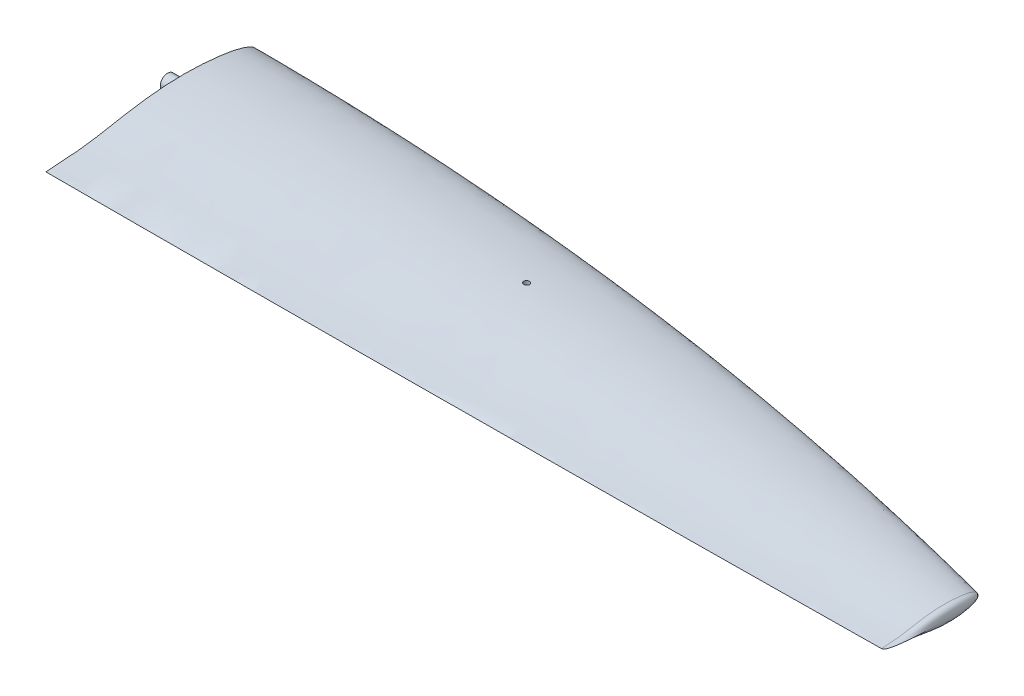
ISO-10303-21;
HEADER;
FILE_DESCRIPTION(('STEP AP214'),'2;1');
FILE_NAME('part.step','',(''),(''),'','','');
FILE_SCHEMA(('AUTOMOTIVE_DESIGN { 1 0 10303 214 1 1 1 1 }'));
ENDSEC;
DATA;
#1=APPLICATION_CONTEXT('core data for automotive mechanical design processes');
#2=APPLICATION_PROTOCOL_DEFINITION('international standard','automotive_design',2000,#1);
#3=PRODUCT_CONTEXT('',#1,'mechanical');
#4=PRODUCT('Part','Part','',(#3));
#5=PRODUCT_RELATED_PRODUCT_CATEGORY('part','',(#4));
#6=PRODUCT_DEFINITION_FORMATION('','',#4);
#7=PRODUCT_DEFINITION_CONTEXT('part definition',#1,'design');
#8=PRODUCT_DEFINITION('design','',#6,#7);
#9=PRODUCT_DEFINITION_SHAPE('','',#8);
#10=(LENGTH_UNIT() NAMED_UNIT(*) SI_UNIT(.MILLI.,.METRE.));
#11=(NAMED_UNIT(*) PLANE_ANGLE_UNIT() SI_UNIT($,.RADIAN.));
#12=(NAMED_UNIT(*) SI_UNIT($,.STERADIAN.) SOLID_ANGLE_UNIT());
#13=UNCERTAINTY_MEASURE_WITH_UNIT(LENGTH_MEASURE(1.E-05),#10,'distance_accuracy_value','');
#14=(GEOMETRIC_REPRESENTATION_CONTEXT(3) GLOBAL_UNCERTAINTY_ASSIGNED_CONTEXT((#13)) GLOBAL_UNIT_ASSIGNED_CONTEXT((#10,
#11,#12)) REPRESENTATION_CONTEXT('',''));
#15=CARTESIAN_POINT('',(0.,0.,0.));
#16=DIRECTION('',(0.,0.,1.));
#17=DIRECTION('',(1.,0.,0.));
#18=AXIS2_PLACEMENT_3D('',#15,#16,#17);
#19=CARTESIAN_POINT('',(0.,-2.15608748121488E-06,-196.200000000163));
#20=CARTESIAN_POINT('',(475.,0.,-196.2));
#21=CARTESIAN_POINT('',(950.,0.,-133.633333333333));
#22=CARTESIAN_POINT('',(1425.,-9.80039763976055E-07,-8.50000000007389));
#23=CARTESIAN_POINT('',(0.,-0.244265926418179,-196.200018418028));
#24=CARTESIAN_POINT('',(475.,-0.199852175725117,-196.200015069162));
#25=CARTESIAN_POINT('',(950.,-0.155440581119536,-133.633345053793));
#26=CARTESIAN_POINT('',(1425.,-0.111029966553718,-8.5000083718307));
#27=CARTESIAN_POINT('',(0.,-0.73285632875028,-196.187251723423));
#28=CARTESIAN_POINT('',(475.,-0.599746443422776,-196.188551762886));
#29=CARTESIAN_POINT('',(949.999999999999,-0.466506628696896,-133.624183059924));
#30=CARTESIAN_POINT('',(1425.,-0.333135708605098,-8.49414561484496));
#31=CARTESIAN_POINT('',(0.,-1.46321650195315,-196.12381651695));
#32=CARTESIAN_POINT('',(474.999999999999,-1.19789958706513,-196.132216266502));
#33=CARTESIAN_POINT('',(949.999999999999,-0.931861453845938,-133.579414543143));
#34=CARTESIAN_POINT('',(1425.,-0.665100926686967,-8.46541134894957));
#35=CARTESIAN_POINT('',(0.,-2.18798191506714,-196.011833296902));
#36=CARTESIAN_POINT('',(475.000000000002,-1.79187154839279,-196.033154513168));
#37=CARTESIAN_POINT('',(950.000000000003,-1.39405860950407,-133.500688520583));
#38=CARTESIAN_POINT('',(1425.,-0.994541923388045,-8.41443532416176));
#39=CARTESIAN_POINT('',(0.,-2.90255474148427,-195.847987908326));
#40=CARTESIAN_POINT('',(474.999999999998,-2.377898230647,-195.888782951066));
#41=CARTESIAN_POINT('',(949.999999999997,-1.85017082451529,-133.386128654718));
#42=CARTESIAN_POINT('',(1424.99999999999,-1.31937134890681,-8.34002502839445));
#43=CARTESIAN_POINT('',(0.,-3.602183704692,-195.626401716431));
#44=CARTESIAN_POINT('',(475.000000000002,-2.95204984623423,-195.694222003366));
#45=CARTESIAN_POINT('',(950.000000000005,-2.29709289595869,-133.231831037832));
#46=CARTESIAN_POINT('',(1425.00000000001,-1.63731168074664,-8.23922883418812));
#47=CARTESIAN_POINT('',(0.,-4.27737914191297,-195.340801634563));
#48=CARTESIAN_POINT('',(474.999999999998,-3.50664389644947,-195.444460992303));
#49=CARTESIAN_POINT('',(949.999999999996,-2.72895258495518,-133.034024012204));
#50=CARTESIAN_POINT('',(1424.99999999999,-1.94430403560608,-8.10949071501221));
#51=CARTESIAN_POINT('',(0.,-4.9187088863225,-194.981276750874));
#52=CARTESIAN_POINT('',(475.000000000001,-4.03388907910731,-195.131344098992));
#53=CARTESIAN_POINT('',(950.000000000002,-3.13960254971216,-132.786283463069));
#54=CARTESIAN_POINT('',(1425.,-2.23584812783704,-7.94609487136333));
#55=CARTESIAN_POINT('',(0.,-5.48662510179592,-194.513718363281));
#56=CARTESIAN_POINT('',(475.,-4.50140936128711,-194.726971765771));
#57=CARTESIAN_POINT('',(950.000000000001,-3.50384165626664,-132.466895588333));
#58=CARTESIAN_POINT('',(1425.,-2.49392081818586,-7.73348986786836));
#59=CARTESIAN_POINT('',(0.,-5.97803230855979,-193.96886054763));
#60=CARTESIAN_POINT('',(474.999999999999,-4.90673538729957,-194.256585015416));
#61=CARTESIAN_POINT('',(949.999999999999,-3.81982976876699,-132.095584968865));
#62=CARTESIAN_POINT('',(1425.,-2.7173142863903,-7.48586045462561));
#63=CARTESIAN_POINT('',(0.,-6.45598988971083,-193.413845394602));
#64=CARTESIAN_POINT('',(475.000000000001,-5.30140660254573,-193.775078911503));
#65=CARTESIAN_POINT('',(950.000000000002,-4.1275894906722,-131.714976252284));
#66=CARTESIAN_POINT('',(1425.,-2.93453738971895,-7.23353747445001));
#67=CARTESIAN_POINT('',(0.,-6.91818774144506,-192.844817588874));
#68=CARTESIAN_POINT('',(475.,-5.68356560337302,-193.279371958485));
#69=CARTESIAN_POINT('',(950.,-4.42571921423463,-131.322738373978));
#70=CARTESIAN_POINT('',(1425.,-3.14464741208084,-6.97491690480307));
#71=CARTESIAN_POINT('',(0.,-7.36609680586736,-192.26493166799));
#72=CARTESIAN_POINT('',(474.999999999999,-6.05438467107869,-192.772028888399));
#73=CARTESIAN_POINT('',(949.999999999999,-4.71509565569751,-130.920822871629));
#74=CARTESIAN_POINT('',(1425.,-3.34822860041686,-6.7113137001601));
#75=CARTESIAN_POINT('',(0.,-7.79885815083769,-191.673406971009));
#76=CARTESIAN_POINT('',(475.000000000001,-6.41317749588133,-192.252461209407));
#77=CARTESIAN_POINT('',(950.000000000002,-4.99520822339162,-130.508810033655));
#78=CARTESIAN_POINT('',(1425.,-3.54494917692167,-6.44245354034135));
#79=CARTESIAN_POINT('',(0.,-8.21694744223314,-191.071561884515));
#80=CARTESIAN_POINT('',(475.,-6.76031409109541,-191.721749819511));
#81=CARTESIAN_POINT('',(949.999999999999,-5.26632437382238,-130.087519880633));
#82=CARTESIAN_POINT('',(1425.,-3.73497713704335,-6.1688721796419));
#83=CARTESIAN_POINT('',(0.,-8.62014469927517,-190.459573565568));
#84=CARTESIAN_POINT('',(475.,-7.09562954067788,-191.180085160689));
#85=CARTESIAN_POINT('',(950.,-5.52833735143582,-129.657132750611));
#86=CARTESIAN_POINT('',(1425.,-3.9182669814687,-5.890716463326));
#87=CARTESIAN_POINT('',(0.,-9.1381669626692,-189.631064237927));
#88=CARTESIAN_POINT('',(475.000000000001,-7.527152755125,-190.444074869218));
#89=CARTESIAN_POINT('',(950.000000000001,-5.86566753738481,-129.071750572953));
#90=CARTESIAN_POINT('',(1425.,-4.15371016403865,-5.51409150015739));
#91=CARTESIAN_POINT('',(0.,-9.7488602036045,-188.573006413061));
#92=CARTESIAN_POINT('',(474.999999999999,-8.03730319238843,-189.499189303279));
#93=CARTESIAN_POINT('',(949.999999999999,-6.2647908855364,-128.319247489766));
#94=CARTESIAN_POINT('',(1425.,-4.4313221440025,-5.03318115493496));
#95=CARTESIAN_POINT('',(0.,-10.4280939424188,-187.274005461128));
#96=CARTESIAN_POINT('',(475.,-8.60697243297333,-188.331019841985));
#97=CARTESIAN_POINT('',(950.000000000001,-6.71095235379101,-127.387252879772));
#98=CARTESIAN_POINT('',(1425.,-4.74003257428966,-4.44270479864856));
#99=CARTESIAN_POINT('',(0.,-11.0600429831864,-185.951420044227));
#100=CARTESIAN_POINT('',(475.,-9.1393167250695,-187.133464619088));
#101=CARTESIAN_POINT('',(950.,-7.12841125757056,-126.430175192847));
#102=CARTESIAN_POINT('',(1425.,-5.0273254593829,-3.84155203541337));
#103=CARTESIAN_POINT('',(0.,-11.6512302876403,-184.610203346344));
#104=CARTESIAN_POINT('',(475.,-9.63958363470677,-185.910730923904));
#105=CARTESIAN_POINT('',(950.,-7.52116453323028,-125.451288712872));
#106=CARTESIAN_POINT('',(1425.,-5.29597187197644,-3.2318770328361));
#107=CARTESIAN_POINT('',(0.,-12.2087655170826,-183.254696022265));
#108=CARTESIAN_POINT('',(475.,-10.113674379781,-184.666602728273));
#109=CARTESIAN_POINT('',(950.,-7.8939297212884,-124.453633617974));
#110=CARTESIAN_POINT('',(1425.,-5.54953044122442,-2.61578906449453));
#111=CARTESIAN_POINT('',(0.,-12.7392846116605,-181.888438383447));
#112=CARTESIAN_POINT('',(475.,-10.5668067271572,-183.404091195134));
#113=CARTESIAN_POINT('',(949.999999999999,-8.25053118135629,-123.439504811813));
#114=CARTESIAN_POINT('',(1425.,-5.7904568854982,-1.99467966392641));
#115=CARTESIAN_POINT('',(0.,-13.2506974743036,-180.514938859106));
#116=CARTESIAN_POINT('',(475.,-11.0057189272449,-182.126364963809));
#117=CARTESIAN_POINT('',(950.,-8.59656027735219,-122.411544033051));
#118=CARTESIAN_POINT('',(1425.,-6.02322044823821,-1.37047655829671));
#119=CARTESIAN_POINT('',(0.,-13.7467868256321,-179.135835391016));
#120=CARTESIAN_POINT('',(475.,-11.4331189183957,-180.834813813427));
#121=CARTESIAN_POINT('',(950.000000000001,-8.93367493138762,-121.370705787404));
#122=CARTESIAN_POINT('',(1425.,-6.24845380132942,-0.743511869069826));
#123=CARTESIAN_POINT('',(0.,-14.2269935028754,-177.751118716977));
#124=CARTESIAN_POINT('',(475.,-11.848820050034,-179.52972938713));
#125=CARTESIAN_POINT('',(950.,-9.26208577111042,-120.317395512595));
#126=CARTESIAN_POINT('',(1425.,-6.46678961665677,-0.114117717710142));
#127=CARTESIAN_POINT('',(0.,-14.8470154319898,-175.89793437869));
#128=CARTESIAN_POINT('',(475.,-12.3880706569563,-177.772249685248));
#129=CARTESIAN_POINT('',(950.,-9.68863338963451,-118.896868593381));
#130=CARTESIAN_POINT('',(1425.,-6.74870259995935,0.728208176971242));
#131=CARTESIAN_POINT('',(0.,-15.5845051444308,-173.56912187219));
#132=CARTESIAN_POINT('',(475.,-13.0342030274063,-175.543768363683));
#133=CARTESIAN_POINT('',(950.,-10.2006457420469,-117.091796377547));
#134=CARTESIAN_POINT('',(1425.,-7.0838322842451,1.78679323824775));
#135=CARTESIAN_POINT('',(0.,-16.4123940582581,-170.757127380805));
#136=CARTESIAN_POINT('',(475.,-13.7672600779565,-172.822427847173));
#137=CARTESIAN_POINT('',(949.999999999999,-10.7831968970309,-114.881734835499));
#138=CARTESIAN_POINT('',(1425.,-7.4602035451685,3.06495063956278));
#139=CARTESIAN_POINT('',(0.,-17.1860119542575,-167.929734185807));
#140=CARTESIAN_POINT('',(475.,-14.4600450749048,-170.057042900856));
#141=CARTESIAN_POINT('',(950.,-11.3353142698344,-112.630417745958));
#142=CARTESIAN_POINT('',(1425.,-7.8118186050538,4.35014008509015));
#143=CARTESIAN_POINT('',(0.,-17.9084185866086,-165.088843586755));
#144=CARTESIAN_POINT('',(475.,-15.1149067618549,-167.250682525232));
#145=CARTESIAN_POINT('',(950.,-11.8588337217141,-110.340584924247));
#146=CARTESIAN_POINT('',(1425.,-8.14019857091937,5.64144783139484));
#147=CARTESIAN_POINT('',(0.,-18.5826951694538,-162.236159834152));
#148=CARTESIAN_POINT('',(475.,-15.7341468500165,-164.406229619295));
#149=CARTESIAN_POINT('',(950.,-12.3554755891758,-108.014801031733));
#150=CARTESIAN_POINT('',(1425.,-8.44668053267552,6.93812434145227));
#151=CARTESIAN_POINT('',(0.,-19.2120174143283,-159.373238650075));
#152=CARTESIAN_POINT('',(475.,-16.3201758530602,-161.526458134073));
#153=CARTESIAN_POINT('',(950.000000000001,-12.8270833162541,-105.655561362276));
#154=CARTESIAN_POINT('',(1425.,-8.73273899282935,8.23944986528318));
#155=CARTESIAN_POINT('',(0.,-19.7995818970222,-156.501467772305));
#156=CARTESIAN_POINT('',(475.,-16.8754062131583,-158.61399802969));
#157=CARTESIAN_POINT('',(949.999999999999,-13.2754833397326,-103.26524121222));
#158=CARTESIAN_POINT('',(1425.,-8.99981251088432,9.54480065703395));
#159=CARTESIAN_POINT('',(0.,-20.3486261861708,-153.622098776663));
#160=CARTESIAN_POINT('',(475.,-17.4022900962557,-155.671371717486));
#161=CARTESIAN_POINT('',(950.,-13.7025405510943,-100.846136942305));
#162=CARTESIAN_POINT('',(1425.,-9.24937683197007,10.8536032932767));
#163=CARTESIAN_POINT('',(0.,-20.8623856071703,-150.736230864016));
#164=CARTESIAN_POINT('',(475.,-17.9032777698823,-152.700974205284));
#165=CARTESIAN_POINT('',(950.,-14.1101182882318,-98.4004424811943));
#166=CARTESIAN_POINT('',(1425.,-9.48290649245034,12.1653618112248));
#167=CARTESIAN_POINT('',(0.,-21.3441238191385,-147.844863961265));
#168=CARTESIAN_POINT('',(475.,-18.380837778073,-149.705121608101));
#169=CARTESIAN_POINT('',(950.,-14.5000881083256,-95.930293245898));
#170=CARTESIAN_POINT('',(1425.,-9.70187419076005,13.4796183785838));
#171=CARTESIAN_POINT('',(0.,-21.948047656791,-143.983498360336));
#172=CARTESIAN_POINT('',(475.,-18.9896086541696,-145.679622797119));
#173=CARTESIAN_POINT('',(950.,-14.9990558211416,-92.6068593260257));
#174=CARTESIAN_POINT('',(1425.,-9.97638860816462,15.2347889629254));
#175=CARTESIAN_POINT('',(0.,-22.6391576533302,-139.147175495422));
#176=CARTESIAN_POINT('',(475.,-19.7043180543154,-140.594978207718));
#177=CARTESIAN_POINT('',(950.,-15.5881080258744,-88.4015472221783));
#178=CARTESIAN_POINT('',(1425.,-10.2905271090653,17.4331139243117));
#179=CARTESIAN_POINT('',(0.,-23.3921416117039,-133.333242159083));
#180=CARTESIAN_POINT('',(475.,-20.5074292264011,-134.425062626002));
#181=CARTESIAN_POINT('',(949.999999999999,-16.2543133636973,-83.2887098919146));
#182=CARTESIAN_POINT('',(1425.,-10.6327936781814,20.0758119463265));
#183=CARTESIAN_POINT('',(0.,-24.0698675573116,-127.51004146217));
#184=CARTESIAN_POINT('',(475.,-21.2553050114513,-128.199665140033));
#185=CARTESIAN_POINT('',(950.,-16.878965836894,-78.122076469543));
#186=CARTESIAN_POINT('',(1425.,-10.9408498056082,22.722719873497));
#187=CARTESIAN_POINT('',(0.,-24.6736752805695,-121.678727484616));
#188=CARTESIAN_POINT('',(474.999999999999,-21.9474578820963,-121.931703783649));
#189=CARTESIAN_POINT('',(949.999999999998,-17.4613356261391,-72.9143538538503));
#190=CARTESIAN_POINT('',(1425.,-11.2153084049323,25.3733170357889));
#191=CARTESIAN_POINT('',(0.,-25.2049047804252,-115.840353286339));
#192=CARTESIAN_POINT('',(475.000000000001,-22.5833980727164,-115.634015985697));
#193=CARTESIAN_POINT('',(950.000000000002,-18.0006882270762,-67.6781887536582));
#194=CARTESIAN_POINT('',(1425.,-11.4567752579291,28.0271225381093));
#195=CARTESIAN_POINT('',(0.,-25.6649677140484,-109.995948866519));
#196=CARTESIAN_POINT('',(474.999999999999,-23.1626968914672,-109.319419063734));
#197=CARTESIAN_POINT('',(949.999999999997,-18.4963396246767,-62.4262107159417));
#198=CARTESIAN_POINT('',(1425.,-11.6658960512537,30.6836696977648));
#199=CARTESIAN_POINT('',(0.,-26.0553535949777,-104.146479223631));
#200=CARTESIAN_POINT('',(475.000000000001,-23.6849858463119,-103.000678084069));
#201=CARTESIAN_POINT('',(950.000000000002,-18.947648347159,-57.1710097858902));
#202=CARTESIAN_POINT('',(1425.,-11.8433413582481,33.3425185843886));
#203=CARTESIAN_POINT('',(0.,-26.3775224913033,-98.2928632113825));
#204=CARTESIAN_POINT('',(474.999999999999,-24.1498785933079,-96.6905196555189));
#205=CARTESIAN_POINT('',(949.999999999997,-19.3539666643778,-51.9251452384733));
#206=CARTESIAN_POINT('',(1425.,-11.9897870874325,36.0032523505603));
#207=CARTESIAN_POINT('',(0.,-26.6331381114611,-92.4359662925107));
#208=CARTESIAN_POINT('',(475.,-24.5571435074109,-90.401627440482));
#209=CARTESIAN_POINT('',(950.,-19.7147526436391,-46.7011438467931));
#210=CARTESIAN_POINT('',(1425.,-12.105966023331,38.6654762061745));
#211=CARTESIAN_POINT('',(0.,-26.8235064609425,-86.5765917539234));
#212=CARTESIAN_POINT('',(474.999999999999,-24.9062775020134,-84.1466321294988));
#213=CARTESIAN_POINT('',(949.999999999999,-20.0292791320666,-41.5114886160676));
#214=CARTESIAN_POINT('',(1425.,-12.192511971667,41.3288299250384));
#215=CARTESIAN_POINT('',(0.,-26.947943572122,-80.7154330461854));
#216=CARTESIAN_POINT('',(474.999999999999,-25.1951169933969,-77.938079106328));
#217=CARTESIAN_POINT('',(949.999999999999,-20.2954879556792,-36.3686017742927));
#218=CARTESIAN_POINT('',(1425.,-12.2490571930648,43.99298952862));
#219=CARTESIAN_POINT('',(0.,-27.0250262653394,-72.899192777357));
#220=CARTESIAN_POINT('',(475.,-25.4969999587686,-69.7387258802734));
#221=CARTESIAN_POINT('',(949.999999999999,-20.5833606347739,-29.5903823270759));
#222=CARTESIAN_POINT('',(1425.,-12.284109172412,47.5458277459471));
#223=CARTESIAN_POINT('',(0.,-26.953627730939,-63.1281535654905));
#224=CARTESIAN_POINT('',(475.,-25.7133172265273,-59.6685579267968));
#225=CARTESIAN_POINT('',(950.,-20.8126558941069,-21.2967677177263));
#226=CARTESIAN_POINT('',(1425.,-12.2516447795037,51.9872061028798));
#227=CARTESIAN_POINT('',(0.,-26.5937450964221,-51.4081246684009));
#228=CARTESIAN_POINT('',(474.999999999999,-25.697834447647,-47.9718273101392));
#229=CARTESIAN_POINT('',(949.999999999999,-20.8626084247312,-11.7309510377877));
#230=CARTESIAN_POINT('',(1425.,-12.0880682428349,57.3144923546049));
#231=CARTESIAN_POINT('',(0.,-25.9553973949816,-39.6998770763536));
#232=CARTESIAN_POINT('',(475.,-25.3911119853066,-36.7637406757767));
#233=CARTESIAN_POINT('',(950.,-20.6719476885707,-2.65163745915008));
#234=CARTESIAN_POINT('',(1425.,-11.7979058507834,62.6364201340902));
#235=CARTESIAN_POINT('',(0.,-25.0310654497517,-28.0107749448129));
#236=CARTESIAN_POINT('',(475.,-24.7743243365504,-26.1461213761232));
#237=CARTESIAN_POINT('',(950.,-20.2232220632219,5.84069118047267));
#238=CARTESIAN_POINT('',(1425.,-11.3777600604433,67.949649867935));
#239=CARTESIAN_POINT('',(0.,-24.2397907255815,-20.2339886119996));
#240=CARTESIAN_POINT('',(475.,-24.1607306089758,-19.5278283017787));
#241=CARTESIAN_POINT('',(950.,-19.7534954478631,11.0450224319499));
#242=CARTESIAN_POINT('',(1425.,-11.0180866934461,71.4845506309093));
#243=CARTESIAN_POINT('',(0.,-23.3839785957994,-12.5899250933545));
#244=CARTESIAN_POINT('',(475.,-23.4605206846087,-13.2735945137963));
#245=CARTESIAN_POINT('',(950.,-19.2088877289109,15.9094264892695));
#246=CARTESIAN_POINT('',(1425.,-10.6290811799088,74.9591249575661));
#247=CARTESIAN_POINT('',(0.,-22.4682801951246,-5.07807437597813));
#248=CARTESIAN_POINT('',(475.000000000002,-22.6775039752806,-6.87206551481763));
#249=CARTESIAN_POINT('',(950.000000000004,-18.5923665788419,20.945164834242));
#250=CARTESIAN_POINT('',(1425.,-10.2128694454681,78.3736038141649));
#251=CARTESIAN_POINT('',(0.,-20.8978746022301,6.1638587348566));
#252=CARTESIAN_POINT('',(475.000000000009,-21.2531338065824,3.3796872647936));
#253=CARTESIAN_POINT('',(950.000000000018,-17.4535140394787,29.1529279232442));
#254=CARTESIAN_POINT('',(1425.,-9.49901669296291,83.4835682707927));
#255=CARTESIAN_POINT('',(0.,-19.1519507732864,17.3797789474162));
#256=CARTESIAN_POINT('',(475.000000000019,-19.6091004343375,14.1849656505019));
#257=CARTESIAN_POINT('',(950.000000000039,-16.1269345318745,37.9189500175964));
#258=CARTESIAN_POINT('',(1425.,-8.70545438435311,88.581720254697));
#259=CARTESIAN_POINT('',(0.,-17.5753317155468,26.7065230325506));
#260=CARTESIAN_POINT('',(475.00000000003,-18.0866605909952,23.572285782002));
#261=CARTESIAN_POINT('',(950.00000000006,-14.8911442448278,45.6104972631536));
#262=CARTESIAN_POINT('',(1425.,-7.98878391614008,92.8211463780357));
#263=CARTESIAN_POINT('',(0.,-16.263222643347,34.1590320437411));
#264=CARTESIAN_POINT('',(475.000000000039,-16.8017823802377,31.2664741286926));
#265=CARTESIAN_POINT('',(950.000000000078,-13.8448335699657,51.9496840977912));
#266=CARTESIAN_POINT('',(1425.,-7.39237737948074,96.2086514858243));
#267=CARTESIAN_POINT('',(0.,-15.2583077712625,39.7447171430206));
#268=CARTESIAN_POINT('',(475.000000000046,-15.8099812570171,37.1179162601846));
#269=CARTESIAN_POINT('',(950.000000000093,-13.0357438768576,56.7855468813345));
#270=CARTESIAN_POINT('',(1425.,-6.93559673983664,98.7475990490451));
#271=CARTESIAN_POINT('',(0.,-14.2380766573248,45.3276111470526));
#272=CARTESIAN_POINT('',(475.000000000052,-14.7961370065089,43.0389251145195));
#273=CARTESIAN_POINT('',(950.000000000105,-12.2073943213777,61.6914835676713));
#274=CARTESIAN_POINT('',(1425.,-6.47184964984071,101.285277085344));
#275=CARTESIAN_POINT('',(0.,-13.2075564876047,50.9086189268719));
#276=CARTESIAN_POINT('',(475.000000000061,-13.7659539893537,49.0182670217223));
#277=CARTESIAN_POINT('',(950.000000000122,-11.3645814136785,66.6560970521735));
#278=CARTESIAN_POINT('',(1425.,-6.00343974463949,103.822100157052));
#279=CARTESIAN_POINT('',(0.,-12.1716820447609,56.4886306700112));
#280=CARTESIAN_POINT('',(475.000000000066,-12.7250429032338,55.0446931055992));
#281=CARTESIAN_POINT('',(950.000000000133,-10.5120067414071,71.6679745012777));
#282=CARTESIAN_POINT('',(1425.,-5.53257447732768,106.358466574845));
#283=CARTESIAN_POINT('',(0.,-11.1361417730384,62.068706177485));
#284=CARTESIAN_POINT('',(475.000000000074,-11.6796623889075,61.1070989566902));
#285=CARTESIAN_POINT('',(950.000000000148,-9.65491411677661,76.7158224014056));
#286=CARTESIAN_POINT('',(1425.,-5.06189780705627,108.894868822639));
#287=CARTESIAN_POINT('',(0.,-10.1046087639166,67.6495237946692));
#288=CARTESIAN_POINT('',(475.00000000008,-10.6343684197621,67.1940580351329));
#289=CARTESIAN_POINT('',(950.00000000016,-8.79715737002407,81.7880844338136));
#290=CARTESIAN_POINT('',(1425.,-4.59297639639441,111.431595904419));
#291=CARTESIAN_POINT('',(0.,-9.08698549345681,73.2329050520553));
#292=CARTESIAN_POINT('',(475.000000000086,-9.59890016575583,73.295095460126));
#293=CARTESIAN_POINT('',(950.000000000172,-7.94672733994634,86.8739644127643));
#294=CARTESIAN_POINT('',(1425.,-4.13046772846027,113.969505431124));
#295=CARTESIAN_POINT('',(0.,-8.10599658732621,78.8228820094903));
#296=CARTESIAN_POINT('',(475.000000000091,-8.59338060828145,79.4015243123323));
#297=CARTESIAN_POINT('',(950.000000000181,-7.11956033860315,91.9640315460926));
#298=CARTESIAN_POINT('',(1425.,-3.68453642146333,116.51039783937));
#299=CARTESIAN_POINT('',(0.,-7.18133162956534,84.4224935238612));
#300=CARTESIAN_POINT('',(475.000000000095,-7.63554028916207,85.5038635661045));
#301=CARTESIAN_POINT('',(950.00000000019,-6.32984284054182,97.0482600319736));
#302=CARTESIAN_POINT('',(1425.,-3.26423985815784,119.055677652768));
#303=CARTESIAN_POINT('',(0.,-6.33568875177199,90.0346905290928));
#304=CARTESIAN_POINT('',(475.000000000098,-6.74552618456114,91.592549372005));
#305=CARTESIAN_POINT('',(950.000000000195,-5.59358564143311,102.116546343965));
#306=CARTESIAN_POINT('',(1425.,-2.87986762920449,121.606676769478));
#307=CARTESIAN_POINT('',(0.,-5.71444884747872,94.7233594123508));
#308=CARTESIAN_POINT('',(475.0000000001,-6.07608441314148,96.6462008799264));
#309=CARTESIAN_POINT('',(950.0000000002,-5.03708621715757,106.317711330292));
#310=CARTESIAN_POINT('',(1425.,-2.59745471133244,123.737886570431));
#311=CARTESIAN_POINT('',(0.,-5.26260031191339,98.4798664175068));
#312=CARTESIAN_POINT('',(475.000000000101,-5.58066029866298,100.669734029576));
#313=CARTESIAN_POINT('',(950.000000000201,-4.62383184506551,109.658245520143));
#314=CARTESIAN_POINT('',(1425.,-2.3921153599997,125.445397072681));
#315=CARTESIAN_POINT('',(0.,-4.94510583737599,101.299747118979));
#316=CARTESIAN_POINT('',(475.000000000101,-5.22835752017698,103.675954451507));
#317=CARTESIAN_POINT('',(950.000000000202,-4.32924660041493,112.151758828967));
#318=CARTESIAN_POINT('',(1425.,-2.24777345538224,126.727156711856));
#319=CARTESIAN_POINT('',(0.,-4.64743402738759,104.121779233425));
#320=CARTESIAN_POINT('',(475.000000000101,-4.89426104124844,106.668967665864));
#321=CARTESIAN_POINT('',(950.000000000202,-4.04927000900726,114.631675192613));
#322=CARTESIAN_POINT('',(1425.,-2.11246127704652,128.009898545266));
#323=CARTESIAN_POINT('',(0.,-4.36814614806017,106.945691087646));
#324=CARTESIAN_POINT('',(475.000000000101,-4.57738094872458,109.647053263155));
#325=CARTESIAN_POINT('',(950.000000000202,-3.78316285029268,117.096322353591));
#326=CARTESIAN_POINT('',(1425.,-1.98549216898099,129.29349535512));
#327=CARTESIAN_POINT('',(0.,-4.10548994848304,109.77119425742));
#328=CARTESIAN_POINT('',(475.0000000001,-4.27651831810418,112.608479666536));
#329=CARTESIAN_POINT('',(950.0000000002,-3.53008139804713,119.544022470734));
#330=CARTESIAN_POINT('',(1425.,-1.86617947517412,130.577819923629));
#331=CARTESIAN_POINT('',(0.,-3.85806412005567,112.598070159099));
#332=CARTESIAN_POINT('',(475.000000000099,-3.9906357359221,115.551565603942));
#333=CARTESIAN_POINT('',(950.000000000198,-3.28915400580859,121.973128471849));
#334=CARTESIAN_POINT('',(1425.,-1.75361918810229,131.862756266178));
#335=CARTESIAN_POINT('',(0.,-3.62312816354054,115.426007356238));
#336=CARTESIAN_POINT('',(475.000000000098,-3.71780299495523,118.474567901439));
#337=CARTESIAN_POINT('',(950.000000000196,-3.05906263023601,124.381962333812));
#338=CARTESIAN_POINT('',(1425.,-1.64690730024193,133.148188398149));
#339=CARTESIAN_POINT('',(0.,-3.39748768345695,118.254699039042));
#340=CARTESIAN_POINT('',(475.000000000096,-3.45550579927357,121.375730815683));
#341=CARTESIAN_POINT('',(950.000000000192,-2.83777494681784,126.768816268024));
#342=CARTESIAN_POINT('',(1425.,-1.54429533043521,134.433953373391));
#343=CARTESIAN_POINT('',(0.,-3.17840314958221,121.083904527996));
#344=CARTESIAN_POINT('',(475.000000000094,-3.20176740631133,124.253365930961));
#345=CARTESIAN_POINT('',(950.000000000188,-2.62387887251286,129.132051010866));
#346=CARTESIAN_POINT('',(1425.,-1.44473772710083,135.719957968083));
#347=CARTESIAN_POINT('',(0.,-2.96317918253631,123.913405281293));
#348=CARTESIAN_POINT('',(475.000000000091,-2.95454255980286,127.105794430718));
#349=CARTESIAN_POINT('',(950.000000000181,-2.41578114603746,131.470024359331));
#350=CARTESIAN_POINT('',(1425.,-1.3468950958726,137.006093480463));
#351=CARTESIAN_POINT('',(0.,-2.74883863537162,126.742972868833));
#352=CARTESIAN_POINT('',(475.000000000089,-2.71161342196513,129.931334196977));
#353=CARTESIAN_POINT('',(950.000000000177,-2.21182511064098,133.781097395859));
#354=CARTESIAN_POINT('',(1425.,-1.2494738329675,138.292261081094));
#355=CARTESIAN_POINT('',(0.,-2.53247144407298,129.572386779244));
#356=CARTESIAN_POINT('',(475.000000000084,-2.47078794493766,132.72830708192));
#357=CARTESIAN_POINT('',(950.000000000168,-2.01033860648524,136.063631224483));
#358=CARTESIAN_POINT('',(1425.,-1.15112353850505,139.578358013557));
#359=CARTESIAN_POINT('',(0.,-2.30963481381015,132.401301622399));
#360=CARTESIAN_POINT('',(475.000000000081,-2.22863160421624,135.494933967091));
#361=CARTESIAN_POINT('',(950.000000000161,-1.80869725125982,138.315909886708));
#362=CARTESIAN_POINT('',(1425.,-1.04983184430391,140.864228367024));
#363=CARTESIAN_POINT('',(0.,-2.11591467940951,134.758084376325));
#364=CARTESIAN_POINT('',(475.000000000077,-2.02374025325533,137.773732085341));
#365=CARTESIAN_POINT('',(950.000000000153,-1.63902968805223,140.166202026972));
#366=CARTESIAN_POINT('',(1425.,-0.961783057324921,141.935493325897));
#367=CARTESIAN_POINT('',(0.,-1.96157429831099,136.643559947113));
#368=CARTESIAN_POINT('',(475.000000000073,-1.86252070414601,139.580344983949));
#369=CARTESIAN_POINT('',(950.000000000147,-1.50586756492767,141.630000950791));
#370=CARTESIAN_POINT('',(1425.,-0.891614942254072,142.79252707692));
#371=CARTESIAN_POINT('',(0.,-1.84713416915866,138.057774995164));
#372=CARTESIAN_POINT('',(475.000000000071,-1.74380648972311,140.9269738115));
#373=CARTESIAN_POINT('',(950.000000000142,-1.40796723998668,142.719500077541));
#374=CARTESIAN_POINT('',(1425.,-0.839616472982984,143.435353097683));
#375=CARTESIAN_POINT('',(0.,-1.73523818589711,139.472193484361));
#376=CARTESIAN_POINT('',(475.000000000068,-1.62830086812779,142.265161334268));
#377=CARTESIAN_POINT('',(950.000000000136,-1.31280071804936,143.800520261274));
#378=CARTESIAN_POINT('',(1425.,-0.788737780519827,144.078269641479));
#379=CARTESIAN_POINT('',(0.,-1.62661296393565,140.886867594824));
#380=CARTESIAN_POINT('',(475.000000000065,-1.51664453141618,143.594764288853));
#381=CARTESIAN_POINT('',(950.00000000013,-1.22089800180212,144.872909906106));
#382=CARTESIAN_POINT('',(1425.,-0.739373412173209,144.721303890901));
#383=CARTESIAN_POINT('',(0.,-1.52187595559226,142.301835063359));
#384=CARTESIAN_POINT('',(475.000000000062,-1.40935263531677,144.915625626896));
#385=CARTESIAN_POINT('',(950.000000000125,-1.13264718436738,145.936504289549));
#386=CARTESIAN_POINT('',(1425.,-0.691759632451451,145.364470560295));
#387=CARTESIAN_POINT('',(0.,-1.42130065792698,143.717104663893));
#388=CARTESIAN_POINT('',(475.000000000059,-1.30668243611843,146.227565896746));
#389=CARTESIAN_POINT('',(950.000000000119,-1.04826451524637,146.991122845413));
#390=CARTESIAN_POINT('',(1425.,-0.646046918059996,146.007775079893));
#391=CARTESIAN_POINT('',(0.,-1.32502042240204,145.13267285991));
#392=CARTESIAN_POINT('',(475.000000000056,-1.20876296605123,147.530394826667));
#393=CARTESIAN_POINT('',(950.000000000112,-0.967849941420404,148.036575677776));
#394=CARTESIAN_POINT('',(1425.,-0.602281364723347,146.651215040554));
#395=CARTESIAN_POINT('',(0.,-1.23295970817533,146.548521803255));
#396=CARTESIAN_POINT('',(475.000000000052,-1.11555982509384,148.823910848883));
#397=CARTESIAN_POINT('',(950.000000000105,-0.891385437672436,149.072664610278));
#398=CARTESIAN_POINT('',(1425.,-0.56043655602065,147.294782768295));
#399=CARTESIAN_POINT('',(0.,-1.14502118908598,147.964632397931));
#400=CARTESIAN_POINT('',(475.000000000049,-1.02701673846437,150.107911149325));
#401=CARTESIAN_POINT('',(950.000000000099,-0.818831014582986,150.099190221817));
#402=CARTESIAN_POINT('',(1425.,-0.520464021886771,147.938469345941));
#403=CARTESIAN_POINT('',(0.,-1.06091209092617,149.380975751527));
#404=CARTESIAN_POINT('',(475.000000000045,-0.942919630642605,151.382185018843));
#405=CARTESIAN_POINT('',(950.00000000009,-0.750026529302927,151.115947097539));
#406=CARTESIAN_POINT('',(1425.,-0.482232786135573,148.582261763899));
#407=CARTESIAN_POINT('',(0.,-0.980598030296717,150.79753883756));
#408=CARTESIAN_POINT('',(475.000000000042,-0.863264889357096,152.646534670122));
#409=CARTESIAN_POINT('',(950.000000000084,-0.684974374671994,152.122739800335));
#410=CARTESIAN_POINT('',(1425.,-0.445726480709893,149.226154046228));
#411=CARTESIAN_POINT('',(0.,-0.902645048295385,152.214233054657));
#412=CARTESIAN_POINT('',(475.000000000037,-0.786903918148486,153.900700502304));
#413=CARTESIAN_POINT('',(950.000000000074,-0.622786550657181,153.119324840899));
#414=CARTESIAN_POINT('',(1425.,-0.410292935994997,149.870105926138));
#415=CARTESIAN_POINT('',(0.,-0.838292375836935,153.394844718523));
#416=CARTESIAN_POINT('',(475.000000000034,-0.724923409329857,154.937133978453));
#417=CARTESIAN_POINT('',(950.000000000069,-0.572506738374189,153.941101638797));
#418=CARTESIAN_POINT('',(1425.,-0.381042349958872,150.406747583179));
#419=CARTESIAN_POINT('',(0.,-0.786574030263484,154.339321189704));
#420=CARTESIAN_POINT('',(475.000000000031,-0.675850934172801,155.760937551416));
#421=CARTESIAN_POINT('',(950.000000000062,-0.532837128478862,154.593182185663));
#422=CARTESIAN_POINT('',(1425.,-0.357532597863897,150.836054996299));
#423=CARTESIAN_POINT('',(0.,-0.747479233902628,155.047661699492));
#424=CARTESIAN_POINT('',(475.000000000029,-0.639153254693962,156.376086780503));
#425=CARTESIAN_POINT('',(950.000000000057,-0.503248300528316,155.079542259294));
#426=CARTESIAN_POINT('',(1425.,-0.33976435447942,151.158028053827));
#427=CARTESIAN_POINT('',(0.,-0.707915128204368,155.755976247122));
#428=CARTESIAN_POINT('',(475.000000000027,-0.602429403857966,156.988501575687));
#429=CARTESIAN_POINT('',(950.000000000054,-0.473717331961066,155.563172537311));
#430=CARTESIAN_POINT('',(1425.,-0.321778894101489,151.479989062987));
#431=CARTESIAN_POINT('',(0.,-0.667674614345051,156.464252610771));
#432=CARTESIAN_POINT('',(475.000000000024,-0.565515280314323,157.598148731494));
#433=CARTESIAN_POINT('',(950.000000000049,-0.444120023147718,156.04404221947));
#434=CARTESIAN_POINT('',(1425.,-0.303488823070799,151.801933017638));
#435=CARTESIAN_POINT('',(0.,-0.626530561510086,157.172477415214));
#436=CARTESIAN_POINT('',(475.000000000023,-0.528226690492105,158.204993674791));
#437=CARTESIAN_POINT('',(950.000000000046,-0.414312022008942,156.522118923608));
#438=CARTESIAN_POINT('',(1425.,-0.284786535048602,152.123853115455));
#439=CARTESIAN_POINT('',(0.,-0.584201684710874,157.880631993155));
#440=CARTESIAN_POINT('',(475.00000000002,-0.490337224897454,158.808998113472));
#441=CARTESIAN_POINT('',(950.000000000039,-0.384118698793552,156.997368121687));
#442=CARTESIAN_POINT('',(1425.,-0.265546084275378,152.445741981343));
#443=CARTESIAN_POINT('',(0.,-0.540333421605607,158.588694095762));
#444=CARTESIAN_POINT('',(475.000000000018,-0.45155995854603,159.410119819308));
#445=CARTESIAN_POINT('',(950.000000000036,-0.35331767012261,157.469750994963));
#446=CARTESIAN_POINT('',(1425.,-0.245606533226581,152.767587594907));
#447=CARTESIAN_POINT('',(0.,-0.494460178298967,159.296627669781));
#448=CARTESIAN_POINT('',(475.000000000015,-0.411516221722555,160.008307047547));
#449=CARTESIAN_POINT('',(950.000000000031,-0.321614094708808,157.939223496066));
#450=CARTESIAN_POINT('',(1425.,-0.224753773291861,153.089376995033));
#451=CARTESIAN_POINT('',(0.,-0.445919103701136,160.004387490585));
#452=CARTESIAN_POINT('',(475.000000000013,-0.369668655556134,160.603497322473));
#453=CARTESIAN_POINT('',(950.000000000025,-0.28859301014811,158.405729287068));
#454=CARTESIAN_POINT('',(1425.,-0.202692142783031,153.411083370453));
#455=CARTESIAN_POINT('',(0.,-0.402438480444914,160.593967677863));
#456=CARTESIAN_POINT('',(475.000000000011,-0.332632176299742,161.0969142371));
#457=CARTESIAN_POINT('',(950.000000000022,-0.25946083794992,158.791951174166));
#458=CARTESIAN_POINT('',(1425.,-0.182924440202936,153.679078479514));
#459=CARTESIAN_POINT('',(0.,-0.365021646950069,161.065438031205));
#460=CARTESIAN_POINT('',(475.000000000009,-0.301043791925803,161.490036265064));
#461=CARTESIAN_POINT('',(950.000000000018,-0.234677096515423,159.099349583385));
#462=CARTESIAN_POINT('',(1425.,-0.16592153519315,153.893377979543));
#463=CARTESIAN_POINT('',(0.,-0.335292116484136,161.418888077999));
#464=CARTESIAN_POINT('',(475.000000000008,-0.276082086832,161.784027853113));
#465=CARTESIAN_POINT('',(950.000000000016,-0.215119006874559,159.329079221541));
#466=CARTESIAN_POINT('',(1425.,-0.152402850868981,154.054042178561));
#467=CARTESIAN_POINT('',(0.,-0.303477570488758,161.772198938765));
#468=CARTESIAN_POINT('',(475.000000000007,-0.249514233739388,162.077171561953));
#469=CARTESIAN_POINT('',(950.000000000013,-0.194336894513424,159.557983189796));
#470=CARTESIAN_POINT('',(1425.,-0.137945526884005,154.214633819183));
#471=CARTESIAN_POINT('',(0.,-0.268824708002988,162.125155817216));
#472=CARTESIAN_POINT('',(475.000000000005,-0.220719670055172,162.369294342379));
#473=CARTESIAN_POINT('',(950.00000000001,-0.171842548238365,159.785933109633));
#474=CARTESIAN_POINT('',(1425.,-0.122193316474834,154.375072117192));
#475=CARTESIAN_POINT('',(0.,-0.230297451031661,162.477881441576));
#476=CARTESIAN_POINT('',(475.000000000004,-0.18885249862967,162.660489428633));
#477=CARTESIAN_POINT('',(950.000000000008,-0.146979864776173,160.012995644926));
#478=CARTESIAN_POINT('',(1425.,-0.10467952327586,154.535400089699));
#479=CARTESIAN_POINT('',(0.,-0.185574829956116,162.829612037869));
#480=CARTESIAN_POINT('',(475.000000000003,-0.152014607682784,162.950128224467));
#481=CARTESIAN_POINT('',(950.000000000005,-0.118273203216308,160.238680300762));
#482=CARTESIAN_POINT('',(1425.,-0.0843505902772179,154.695268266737));
#483=CARTESIAN_POINT('',(0.,-0.139366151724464,163.121896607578));
#484=CARTESIAN_POINT('',(475.000000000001,-0.11408560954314,163.190208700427));
#485=CARTESIAN_POINT('',(950.000000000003,-0.0887473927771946,160.425623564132));
#486=CARTESIAN_POINT('',(1425.,-0.0633514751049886,154.828141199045));
#487=CARTESIAN_POINT('',(0.,-0.0945820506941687,163.323655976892));
#488=CARTESIAN_POINT('',(475.000000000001,-0.0773990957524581,163.355608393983));
#489=CARTESIAN_POINT('',(950.000000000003,-0.0602017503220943,160.554336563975));
#490=CARTESIAN_POINT('',(1425.,-0.0429899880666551,154.91984048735));
#491=CARTESIAN_POINT('',(0.,-0.0621414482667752,163.422844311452));
#492=CARTESIAN_POINT('',(475.,-0.0508468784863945,163.436845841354));
#493=CARTESIAN_POINT('',(950.,-0.0395487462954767,160.617541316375));
#494=CARTESIAN_POINT('',(1425.,-0.0282470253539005,154.964930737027));
#495=CARTESIAN_POINT('',(0.,-0.0367384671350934,163.474640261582));
#496=CARTESIAN_POINT('',(475.,-0.0300590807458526,163.479246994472));
#497=CARTESIAN_POINT('',(950.000000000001,-0.0233792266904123,160.650524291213));
#498=CARTESIAN_POINT('',(1425.,-0.0166988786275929,154.98847215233));
#499=CARTESIAN_POINT('',(0.,-0.0147766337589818,163.499705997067));
#500=CARTESIAN_POINT('',(475.,-0.0120899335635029,163.499759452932));
#501=CARTESIAN_POINT('',(950.,-0.00940328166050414,160.666479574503));
#502=CARTESIAN_POINT('',(1425.,-0.0067166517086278,154.999866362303));
#503=CARTESIAN_POINT('',(0.,0.0295537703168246,163.50058801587));
#504=CARTESIAN_POINT('',(475.,0.0241803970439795,163.50048110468));
#505=CARTESIAN_POINT('',(950.,0.0188069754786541,160.667040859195));
#506=CARTESIAN_POINT('',(1425.,0.0134335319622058,155.000267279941));
#507=CARTESIAN_POINT('',(0.,0.0586280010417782,163.426922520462));
#508=CARTESIAN_POINT('',(475.,0.0479645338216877,163.440475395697));
#509=CARTESIAN_POINT('',(950.000000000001,0.0372989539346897,160.620710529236));
#510=CARTESIAN_POINT('',(1425.,0.0266312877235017,154.967627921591));
#511=CARTESIAN_POINT('',(0.,0.085856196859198,163.358883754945));
#512=CARTESIAN_POINT('',(475.,0.0702643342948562,163.38423257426));
#513=CARTESIAN_POINT('',(950.,0.0546610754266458,160.576333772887));
#514=CARTESIAN_POINT('',(1425.,0.0390464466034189,154.935187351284));
#515=CARTESIAN_POINT('',(0.,0.108110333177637,163.263627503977));
#516=CARTESIAN_POINT('',(475.,0.0884746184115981,163.30659787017));
#517=CARTESIAN_POINT('',(950.000000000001,0.0688120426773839,160.516437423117));
#518=CARTESIAN_POINT('',(1425.,0.0491226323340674,154.893146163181));
#519=CARTESIAN_POINT('',(0.,0.126492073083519,163.182254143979));
#520=CARTESIAN_POINT('',(475.000000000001,0.10354851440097,163.239447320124));
#521=CARTESIAN_POINT('',(950.000000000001,0.0805564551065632,160.463673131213));
#522=CARTESIAN_POINT('',(1425.,0.0575159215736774,154.854931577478));
#523=CARTESIAN_POINT('',(0.,0.143097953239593,163.092099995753));
#524=CARTESIAN_POINT('',(475.000000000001,0.117149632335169,163.165925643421));
#525=CARTESIAN_POINT('',(950.000000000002,0.0911250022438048,160.406993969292));
#526=CARTESIAN_POINT('',(1425.,0.0650240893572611,154.815304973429));
#527=CARTESIAN_POINT('',(0.,0.157996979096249,163.006342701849));
#528=CARTESIAN_POINT('',(475.000000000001,0.129384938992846,163.095119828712));
#529=CARTESIAN_POINT('',(950.000000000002,0.100662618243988,160.351396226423));
#530=CARTESIAN_POINT('',(1425.,0.0718300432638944,154.775171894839));
#531=CARTESIAN_POINT('',(0.,0.171859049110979,162.917907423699));
#532=CARTESIAN_POINT('',(475.000000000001,0.140761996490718,163.022615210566));
#533=CARTESIAN_POINT('',(950.000000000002,0.109514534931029,160.295125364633));
#534=CARTESIAN_POINT('',(1425.,0.078116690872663,154.735437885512));
#535=CARTESIAN_POINT('',(0.,0.189067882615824,162.801374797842));
#536=CARTESIAN_POINT('',(475.000000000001,0.154903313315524,162.926824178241));
#537=CARTESIAN_POINT('',(950.000000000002,0.120526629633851,160.220541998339));
#538=CARTESIAN_POINT('',(1425.,0.0859378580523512,154.682528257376));
#539=CARTESIAN_POINT('',(0.,0.208794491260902,162.654605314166));
#540=CARTESIAN_POINT('',(475.000000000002,0.171137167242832,162.805987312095));
#541=CARTESIAN_POINT('',(950.000000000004,0.133175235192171,160.126336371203));
#542=CARTESIAN_POINT('',(1425.,0.0949087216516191,154.615652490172));
#543=CARTESIAN_POINT('',(0.,0.230387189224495,162.478731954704));
#544=CARTESIAN_POINT('',(475.000000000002,0.188938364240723,162.6611072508));
#545=CARTESIAN_POINT('',(950.000000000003,0.147049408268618,160.013473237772));
#546=CARTESIAN_POINT('',(1425.,0.104720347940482,154.535829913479));
#547=CARTESIAN_POINT('',(0.,0.250426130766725,162.302419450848));
#548=CARTESIAN_POINT('',(475.000000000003,0.205494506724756,162.515620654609));
#549=CARTESIAN_POINT('',(950.000000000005,0.159962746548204,159.900021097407));
#550=CARTESIAN_POINT('',(1425.,0.113830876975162,154.455620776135));
#551=CARTESIAN_POINT('',(0.,0.269229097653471,162.126108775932));
#552=CARTESIAN_POINT('',(475.000000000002,0.221062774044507,162.369985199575));
#553=CARTESIAN_POINT('',(950.000000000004,0.17211187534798,159.786453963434));
#554=CARTESIAN_POINT('',(1425.,0.122376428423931,154.375515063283));
#555=CARTESIAN_POINT('',(0.,0.287032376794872,161.949620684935));
#556=CARTESIAN_POINT('',(475.000000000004,0.235838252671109,162.224003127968));
#557=CARTESIAN_POINT('',(950.000000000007,0.183650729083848,159.67255519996));
#558=CARTESIAN_POINT('',(1425.,0.130469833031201,154.295276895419));
#559=CARTESIAN_POINT('',(0.,0.304000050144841,161.773088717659));
#560=CARTESIAN_POINT('',(475.000000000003,0.249953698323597,162.077808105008));
#561=CARTESIAN_POINT('',(950.000000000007,0.194680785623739,159.558458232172));
#562=CARTESIAN_POINT('',(1425.,0.138181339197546,154.215039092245));
#563=CARTESIAN_POINT('',(0.,0.320260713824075,161.596471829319));
#564=CARTESIAN_POINT('',(475.000000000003,0.263515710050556,161.931359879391));
#565=CARTESIAN_POINT('',(950.000000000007,0.205286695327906,159.444123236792));
#566=CARTESIAN_POINT('',(1425.,0.145573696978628,154.134761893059));
#567=CARTESIAN_POINT('',(0.,0.335911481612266,161.419808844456));
#568=CARTESIAN_POINT('',(475.000000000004,0.276602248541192,161.784688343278));
#569=CARTESIAN_POINT('',(950.000000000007,0.21552731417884,159.329570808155));
#570=CARTESIAN_POINT('',(1425.,0.152686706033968,154.054456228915));
#571=CARTESIAN_POINT('',(0.,0.351031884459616,161.243095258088));
#572=CARTESIAN_POINT('',(475.000000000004,0.289279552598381,161.637794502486));
#573=CARTESIAN_POINT('',(950.000000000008,0.225455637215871,159.214807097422));
#574=CARTESIAN_POINT('',(1425.,0.159560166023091,153.97413303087));
#575=CARTESIAN_POINT('',(0.,0.370567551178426,161.007427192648));
#576=CARTESIAN_POINT('',(475.000000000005,0.305703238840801,161.441651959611));
#577=CARTESIAN_POINT('',(950.000000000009,0.238327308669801,159.061513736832));
#578=CARTESIAN_POINT('',(1425.,0.168439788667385,153.867012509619));
#579=CARTESIAN_POINT('',(0.,0.393952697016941,160.712756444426));
#580=CARTESIAN_POINT('',(475.000000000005,0.32544684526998,161.195947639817));
#581=CARTESIAN_POINT('',(950.00000000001,0.253819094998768,158.869385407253));
#582=CARTESIAN_POINT('',(1425.,0.179069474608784,153.733069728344));
#583=CARTESIAN_POINT('',(0.,0.42068275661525,160.359049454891));
#584=CARTESIAN_POINT('',(475.000000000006,0.348145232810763,160.900294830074));
#585=CARTESIAN_POINT('',(950.000000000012,0.271657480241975,158.638043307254));
#586=CARTESIAN_POINT('',(1425.,0.191219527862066,153.57229486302));
#587=CARTESIAN_POINT('',(0.,0.446313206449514,160.00526080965));
#588=CARTESIAN_POINT('',(475.000000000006,0.37003948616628,160.603852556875));
#589=CARTESIAN_POINT('',(950.000000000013,0.288891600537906,158.405926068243));
#590=CARTESIAN_POINT('',(1425.,0.202869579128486,153.411481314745));
#591=CARTESIAN_POINT('',(0.,0.471022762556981,159.651406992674));
#592=CARTESIAN_POINT('',(475.000000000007,0.391275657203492,160.306638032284));
#593=CARTESIAN_POINT('',(950.000000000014,0.305635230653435,158.173048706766));
#594=CARTESIAN_POINT('',(1425.,0.214101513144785,153.250638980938));
#595=CARTESIAN_POINT('',(0.,0.494949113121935,159.297499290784));
#596=CARTESIAN_POINT('',(475.000000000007,0.411965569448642,160.00866299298));
#597=CARTESIAN_POINT('',(950.000000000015,0.321974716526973,157.93942048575));
#598=CARTESIAN_POINT('',(1425.,0.224976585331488,153.089771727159));
#599=CARTESIAN_POINT('',(0.,0.51820481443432,158.943547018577));
#600=CARTESIAN_POINT('',(475.000000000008,0.432201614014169,159.709938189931));
#601=CARTESIAN_POINT('',(950.000000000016,0.33798267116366,157.705050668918));
#602=CARTESIAN_POINT('',(1425.,0.235548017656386,152.928884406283));
#603=CARTESIAN_POINT('',(0.,0.548435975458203,158.471560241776));
#604=CARTESIAN_POINT('',(475.000000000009,0.458672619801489,159.310649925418));
#605=CARTESIAN_POINT('',(950.000000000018,0.358956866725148,157.39157818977));
#606=CARTESIAN_POINT('',(1425.,0.249288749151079,152.71434497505));
#607=CARTESIAN_POINT('',(0.,0.584966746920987,157.881497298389));
#608=CARTESIAN_POINT('',(475.00000000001,0.490966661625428,158.809705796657));
#609=CARTESIAN_POINT('',(950.00000000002,0.384609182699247,156.997918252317));
#610=CARTESIAN_POINT('',(1425.,0.265894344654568,152.446134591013));
#611=CARTESIAN_POINT('',(0.,0.627263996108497,157.173328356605));
#612=CARTESIAN_POINT('',(475.000000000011,0.528830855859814,158.20568973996));
#613=CARTESIAN_POINT('',(950.000000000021,0.414782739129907,156.522660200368));
#614=CARTESIAN_POINT('',(1425.,0.285119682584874,152.12423964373));
#615=CARTESIAN_POINT('',(0.,0.668372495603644,156.465089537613));
#616=CARTESIAN_POINT('',(475.000000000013,0.566091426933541,157.598833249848));
#617=CARTESIAN_POINT('',(950.000000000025,0.444569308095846,156.044574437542));
#618=CARTESIAN_POINT('',(1425.,0.30380617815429,151.802312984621));
#619=CARTESIAN_POINT('',(0.,0.708575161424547,155.756798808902));
#620=CARTESIAN_POINT('',(475.000000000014,0.602975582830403,156.989174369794));
#621=CARTESIAN_POINT('',(950.000000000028,0.474143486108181,155.563695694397));
#622=CARTESIAN_POINT('',(1425.,0.322078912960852,151.48036264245));
#623=CARTESIAN_POINT('',(0.,0.748097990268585,155.048469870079));
#624=CARTESIAN_POINT('',(475.000000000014,0.639666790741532,156.376747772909));
#625=CARTESIAN_POINT('',(950.000000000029,0.50364930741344,155.080056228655));
#626=CARTESIAN_POINT('',(1425.,0.340045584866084,151.158395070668));
#627=CARTESIAN_POINT('',(0.,0.787147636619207,154.340114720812));
#628=CARTESIAN_POINT('',(475.000000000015,0.676328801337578,155.761586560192));
#629=CARTESIAN_POINT('',(950.00000000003,0.53321071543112,154.593686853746));
#630=CARTESIAN_POINT('',(1425.,0.357793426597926,150.836415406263));
#631=CARTESIAN_POINT('',(0.,0.838800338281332,153.395618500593));
#632=CARTESIAN_POINT('',(475.000000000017,0.725349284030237,154.937766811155));
#633=CARTESIAN_POINT('',(950.000000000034,0.572840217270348,153.941593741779));
#634=CARTESIAN_POINT('',(1425.,0.381273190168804,150.407099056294));
#635=CARTESIAN_POINT('',(0.,0.903056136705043,152.214981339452));
#636=CARTESIAN_POINT('',(475.000000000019,0.787253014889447,153.901312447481));
#637=CARTESIAN_POINT('',(950.000000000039,0.623060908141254,153.11980071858));
#638=CARTESIAN_POINT('',(1425.,0.410479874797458,149.870445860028));
#639=CARTESIAN_POINT('',(0.,0.980862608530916,150.798254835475));
#640=CARTESIAN_POINT('',(475.00000000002,0.863497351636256,152.647120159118));
#641=CARTESIAN_POINT('',(950.00000000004,0.685158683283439,152.123195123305));
#642=CARTESIAN_POINT('',(1425.,0.445846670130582,149.226479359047));
#643=CARTESIAN_POINT('',(0.,1.06096935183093,149.381655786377));
#644=CARTESIAN_POINT('',(475.000000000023,0.942986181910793,151.382741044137));
#645=CARTESIAN_POINT('',(950.000000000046,0.750082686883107,151.116379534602));
#646=CARTESIAN_POINT('',(1425.,0.482258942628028,148.582570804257));
#647=CARTESIAN_POINT('',(0.,1.14479796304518,147.965271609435));
#648=CARTESIAN_POINT('',(475.000000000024,1.0268576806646,150.108433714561));
#649=CARTESIAN_POINT('',(950.000000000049,0.818712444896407,150.099596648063));
#650=CARTESIAN_POINT('',(1425.,0.52036234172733,147.938759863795));
#651=CARTESIAN_POINT('',(0.,1.23237959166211,146.549114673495));
#652=CARTESIAN_POINT('',(475.000000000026,1.11511330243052,148.824395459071));
#653=CARTESIAN_POINT('',(950.000000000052,0.891044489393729,149.07304156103));
#654=CARTESIAN_POINT('',(1425.,0.560173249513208,147.295052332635));
#655=CARTESIAN_POINT('',(0.,1.32400238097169,145.133213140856));
#656=CARTESIAN_POINT('',(475.000000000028,1.20796245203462,147.530836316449));
#657=CARTESIAN_POINT('',(950.000000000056,0.967234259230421,148.036919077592));
#658=CARTESIAN_POINT('',(1425.,0.601817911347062,146.651460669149));
#659=CARTESIAN_POINT('',(0.,1.41976438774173,143.717585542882));
#660=CARTESIAN_POINT('',(475.000000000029,1.30546357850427,146.227958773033));
#661=CARTESIAN_POINT('',(950.000000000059,1.04732536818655,146.991428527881));
#662=CARTESIAN_POINT('',(1425.,0.645349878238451,146.007993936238));
#663=CARTESIAN_POINT('',(0.,1.519762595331,142.302250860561));
#664=CARTESIAN_POINT('',(475.000000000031,1.40766573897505,144.91596507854));
#665=CARTESIAN_POINT('',(950.000000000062,1.13134371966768,145.936768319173));
#666=CARTESIAN_POINT('',(1425.,0.690796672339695,145.364659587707));
#667=CARTESIAN_POINT('',(0.,1.62388270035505,140.887213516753));
#668=CARTESIAN_POINT('',(475.000000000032,1.51446071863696,143.59504667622));
#669=CARTESIAN_POINT('',(950.000000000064,1.21921195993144,144.873129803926));
#670=CARTESIAN_POINT('',(1425.,0.73813657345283,144.721461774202));
#671=CARTESIAN_POINT('',(0.,1.73192733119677,139.472470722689));
#672=CARTESIAN_POINT('',(475.000000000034,1.62564411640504,142.265387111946));
#673=CARTESIAN_POINT('',(950.000000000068,1.31074343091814,143.800695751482));
#674=CARTESIAN_POINT('',(1425.,0.787225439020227,144.078395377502));
#675=CARTESIAN_POINT('',(0.,1.84330899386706,138.05798713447));
#676=CARTESIAN_POINT('',(475.000000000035,1.74074130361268,140.927146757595));
#677=CARTESIAN_POINT('',(950.000000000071,1.40560114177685,142.719635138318));
#678=CARTESIAN_POINT('',(1425.,0.83788868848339,143.435450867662));
#679=CARTESIAN_POINT('',(0.,1.95746660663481,136.643725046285));
#680=CARTESIAN_POINT('',(475.000000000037,1.85922338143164,139.580478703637));
#681=CARTESIAN_POINT('',(950.000000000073,1.50331314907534,141.630104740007));
#682=CARTESIAN_POINT('',(1425.,0.889736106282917,142.792601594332));
#683=CARTESIAN_POINT('',(0.,2.11168222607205,134.758206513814));
#684=CARTESIAN_POINT('',(475.000000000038,2.02035594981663,137.773831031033));
#685=CARTESIAN_POINT('',(950.000000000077,1.63641693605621,140.166279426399));
#686=CARTESIAN_POINT('',(1425.,0.959865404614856,141.935549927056));
#687=CARTESIAN_POINT('',(0.,2.30630759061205,132.401458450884));
#688=CARTESIAN_POINT('',(475.00000000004,2.22599631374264,135.495060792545));
#689=CARTESIAN_POINT('',(950.000000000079,1.80666516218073,138.316008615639));
#690=CARTESIAN_POINT('',(1425.,1.04831438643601,140.864299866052));
#691=CARTESIAN_POINT('',(0.,2.53119858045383,129.572657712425));
#692=CARTESIAN_POINT('',(475.000000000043,2.46985208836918,132.7285272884));
#693=CARTESIAN_POINT('',(950.000000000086,2.00963537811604,136.06380294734));
#694=CARTESIAN_POINT('',(1425.,1.15054873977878,139.578482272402));
#695=CARTESIAN_POINT('',(0.,2.74809344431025,126.743234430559));
#696=CARTESIAN_POINT('',(475.000000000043,2.71112329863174,129.931546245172));
#697=CARTESIAN_POINT('',(950.000000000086,2.21146899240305,133.781262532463));
#698=CARTESIAN_POINT('',(1425.,1.24913085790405,138.292380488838));
#699=CARTESIAN_POINT('',(0.,2.96262735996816,123.913633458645));
#700=CARTESIAN_POINT('',(475.000000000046,2.9542317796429,127.105979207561));
#701=CARTESIAN_POINT('',(950.000000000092,2.41557267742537,131.470168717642));
#702=CARTESIAN_POINT('',(1425.,1.34665043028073,137.006198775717));
#703=CARTESIAN_POINT('',(0.,3.17765247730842,121.084068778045));
#704=CARTESIAN_POINT('',(475.000000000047,3.20130682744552,124.253497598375));
#705=CARTESIAN_POINT('',(950.000000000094,2.6235510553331,129.132153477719));
#706=CARTESIAN_POINT('',(1425.,1.44438558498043,135.720032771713));
#707=CARTESIAN_POINT('',(0.,3.39658422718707,118.254802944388));
#708=CARTESIAN_POINT('',(475.000000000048,3.45494986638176,121.375813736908));
#709=CARTESIAN_POINT('',(950.000000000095,2.83738972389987,126.768882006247));
#710=CARTESIAN_POINT('',(1425.,1.54390427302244,134.434003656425));
#711=CARTESIAN_POINT('',(0.,3.62214421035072,115.426056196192));
#712=CARTESIAN_POINT('',(475.000000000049,3.71718322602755,118.474603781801));
#713=CARTESIAN_POINT('',(950.000000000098,3.05860992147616,124.381989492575));
#714=CARTESIAN_POINT('',(1425.,1.64642482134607,133.148208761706));
#715=CARTESIAN_POINT('',(0.,3.85735164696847,112.598092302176));
#716=CARTESIAN_POINT('',(475.000000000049,3.99028867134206,115.551582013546));
#717=CARTESIAN_POINT('',(950.000000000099,3.28895413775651,121.973143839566));
#718=CARTESIAN_POINT('',(1425.,1.75334862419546,131.86277272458));
#719=CARTESIAN_POINT('',(0.,4.10523796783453,109.771208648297));
#720=CARTESIAN_POINT('',(475.00000000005,4.27653224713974,112.608485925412));
#721=CARTESIAN_POINT('',(950.0000000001,3.5301212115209,119.544025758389));
#722=CARTESIAN_POINT('',(1425.,1.86600549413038,130.577822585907));
#723=CARTESIAN_POINT('',(0.,4.36936647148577,106.945789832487));
#724=CARTESIAN_POINT('',(475.00000000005,4.5786584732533,109.647131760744));
#725=CARTESIAN_POINT('',(950.0000000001,3.78423506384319,117.096386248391));
#726=CARTESIAN_POINT('',(1425.,1.98609693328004,129.293547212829));
#727=CARTESIAN_POINT('',(0.,4.65120573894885,104.122086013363));
#728=CARTESIAN_POINT('',(475.00000000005,4.89762675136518,106.669213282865));
#729=CARTESIAN_POINT('',(950.000000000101,4.05194409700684,114.631865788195));
#730=CARTESIAN_POINT('',(1425.,2.1141585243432,128.010036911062));
#731=CARTESIAN_POINT('',(0.,5.05165737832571,100.359679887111));
#732=CARTESIAN_POINT('',(475.00000000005,5.34604123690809,102.678779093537));
#733=CARTESIAN_POINT('',(950.000000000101,4.42756378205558,111.325508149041));
#734=CARTESIAN_POINT('',(1425.,2.29622584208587,126.299859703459));
#735=CARTESIAN_POINT('',(0.,5.60196802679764,95.662150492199));
#736=CARTESIAN_POINT('',(475.00000000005,5.9521842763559,97.6577910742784));
#737=CARTESIAN_POINT('',(950.000000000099,4.93363765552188,107.158614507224));
#738=CARTESIAN_POINT('',(1425.,2.5463290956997,124.164612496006));
#739=CARTESIAN_POINT('',(0.,6.34714169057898,90.0356393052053));
#740=CARTESIAN_POINT('',(475.000000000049,6.75530879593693,91.5933209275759));
#741=CARTESIAN_POINT('',(950.000000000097,5.60128940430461,102.11714946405));
#742=CARTESIAN_POINT('',(1425.,2.88508457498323,121.607115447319));
#743=CARTESIAN_POINT('',(0.,7.18446595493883,84.4221267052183));
#744=CARTESIAN_POINT('',(475.000000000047,7.63856926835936,85.5035564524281));
#745=CARTESIAN_POINT('',(950.000000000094,6.33230613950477,97.0480225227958));
#746=CARTESIAN_POINT('',(1425.,3.26567775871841,119.055514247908));
#747=CARTESIAN_POINT('',(0.,8.09976046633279,78.8208664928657));
#748=CARTESIAN_POINT('',(475.000000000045,8.58878914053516,79.3998670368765));
#749=CARTESIAN_POINT('',(950.000000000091,7.11610054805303,91.9627435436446));
#750=CARTESIAN_POINT('',(1425.,3.68169601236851,116.509484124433));
#751=CARTESIAN_POINT('',(0.,9.07237277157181,73.2293294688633));
#752=CARTESIAN_POINT('',(475.000000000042,9.58750591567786,73.2921600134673));
#753=CARTESIAN_POINT('',(950.000000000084,7.93798552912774,86.8716812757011));
#754=CARTESIAN_POINT('',(1425.,4.12381306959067,113.967880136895));
#755=CARTESIAN_POINT('',(0.,10.085214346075,67.6449685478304));
#756=CARTESIAN_POINT('',(475.00000000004,10.6191262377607,67.1903224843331));
#757=CARTESIAN_POINT('',(950.000000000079,8.78544833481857,81.7851818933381));
#758=CARTESIAN_POINT('',(1425.,4.58418222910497,111.429532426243));
#759=CARTESIAN_POINT('',(0.,11.1198353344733,62.0646228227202));
#760=CARTESIAN_POINT('',(475.000000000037,11.6669879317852,61.1037464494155));
#761=CARTESIAN_POINT('',(950.000000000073,9.64519991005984,76.7132151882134));
#762=CARTESIAN_POINT('',(1425.,5.05447299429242,108.893013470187));
#763=CARTESIAN_POINT('',(0.,12.1601182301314,56.4853312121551));
#764=CARTESIAN_POINT('',(475.000000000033,12.7163068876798,55.0419823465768));
#765=CARTESIAN_POINT('',(950.000000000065,10.5053749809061,71.6658680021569));
#766=CARTESIAN_POINT('',(1425.,5.52732436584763,106.356971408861));
#767=CARTESIAN_POINT('',(0.,13.2014477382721,50.9062355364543));
#768=CARTESIAN_POINT('',(475.00000000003,13.7617281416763,49.0163042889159));
#769=CARTESIAN_POINT('',(950.00000000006,11.3614643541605,66.6545716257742));
#770=CARTESIAN_POINT('',(1425.,6.00065835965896,103.821019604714));
#771=CARTESIAN_POINT('',(0.,14.2381345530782,45.3262735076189));
#772=CARTESIAN_POINT('',(475.000000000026,14.7970077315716,43.0378176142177));
#773=CARTESIAN_POINT('',(950.000000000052,12.2082548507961,61.690623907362));
#774=CARTESIAN_POINT('',(1425.,6.47187801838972,101.284673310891));
#775=CARTESIAN_POINT('',(0.,15.2649114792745,39.7444779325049));
#776=CARTESIAN_POINT('',(475.000000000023,15.8162530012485,37.1177064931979));
#777=CARTESIAN_POINT('',(950.000000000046,13.040813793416,56.7853852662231));
#778=CARTESIAN_POINT('',(1425.,6.93859608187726,98.7474940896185));
#779=CARTESIAN_POINT('',(0.,16.2762638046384,34.1598614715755));
#780=CARTESIAN_POINT('',(475.000000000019,16.8133647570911,31.2671378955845));
#781=CARTESIAN_POINT('',(950.000000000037,13.8540429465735,51.9502018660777));
#782=CARTESIAN_POINT('',(1425.,7.39830071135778,96.2090321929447));
#783=CARTESIAN_POINT('',(0.,17.5969616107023,26.708727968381));
#784=CARTESIAN_POINT('',(475.000000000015,18.1053276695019,23.5740744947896));
#785=CARTESIAN_POINT('',(950.00000000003,14.9058790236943,45.6118906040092));
#786=CARTESIAN_POINT('',(1425.,7.99861815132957,92.822153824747));
#787=CARTESIAN_POINT('',(0.,19.1820075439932,17.3832609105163));
#788=CARTESIAN_POINT('',(475.000000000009,19.6347144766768,14.1877969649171));
#789=CARTESIAN_POINT('',(950.000000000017,16.1470755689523,37.9211528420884));
#790=CARTESIAN_POINT('',(1425.,8.7190934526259,88.5833046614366));
#791=CARTESIAN_POINT('',(0.,20.9350505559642,6.16820294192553));
#792=CARTESIAN_POINT('',(475.000000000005,21.2846424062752,3.38322468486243));
#793=CARTESIAN_POINT('',(950.00000000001,17.4782686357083,29.1556819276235));
#794=CARTESIAN_POINT('',(1425.,9.51593201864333,83.4855494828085));
#795=CARTESIAN_POINT('',(0.,22.4951094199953,-5.07543895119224));
#796=CARTESIAN_POINT('',(475.,22.7005726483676,-6.86992955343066));
#797=CARTESIAN_POINT('',(950.,18.6105515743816,20.9468254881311));
#798=CARTESIAN_POINT('',(1425.,10.2250490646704,78.3748001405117));
#799=CARTESIAN_POINT('',(0.,23.3970559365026,-12.5890979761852));
#800=CARTESIAN_POINT('',(475.,23.4723518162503,-13.2729377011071));
#801=CARTESIAN_POINT('',(950.,19.218340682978,15.9099373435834));
#802=CARTESIAN_POINT('',(1425.,10.635025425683,74.9595009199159));
#803=CARTESIAN_POINT('',(0.,24.2389214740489,-20.2349492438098));
#804=CARTESIAN_POINT('',(475.,24.1611508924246,-19.5286341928));
#805=CARTESIAN_POINT('',(950.,19.7540732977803,11.0443956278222));
#806=CARTESIAN_POINT('',(1425.,11.0176915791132,71.4841139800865));
#807=CARTESIAN_POINT('',(0.,25.0155920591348,-28.0135320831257));
#808=CARTESIAN_POINT('',(475.000000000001,24.7627847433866,-26.1483974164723));
#809=CARTESIAN_POINT('',(950.000000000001,20.2144931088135,5.83892039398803));
#810=CARTESIAN_POINT('',(1425.,11.3707200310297,67.9483953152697));
#811=CARTESIAN_POINT('',(0.,25.929334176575,-39.7038950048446));
#812=CARTESIAN_POINT('',(475.,25.3708768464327,-36.7670470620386));
#813=CARTESIAN_POINT('',(949.999999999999,20.6564538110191,-2.65420893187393));
#814=CARTESIAN_POINT('',(1425.,11.7860678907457,62.6345941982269));
#815=CARTESIAN_POINT('',(0.,26.5734875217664,-51.4122657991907));
#816=CARTESIAN_POINT('',(475.000000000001,25.6822788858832,-47.9752353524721));
#817=CARTESIAN_POINT('',(950.000000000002,20.8507242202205,-11.733603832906));
#818=CARTESIAN_POINT('',(1425.,12.0788262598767,57.3126048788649));
#819=CARTESIAN_POINT('',(0.,26.942190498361,-63.1325545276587));
#820=CARTESIAN_POINT('',(475.,25.7049351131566,-59.6721757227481));
#821=CARTESIAN_POINT('',(949.999999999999,20.8063709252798,-21.2995817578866));
#822=CARTESIAN_POINT('',(1425.,12.2465005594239,51.9852051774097));
#823=CARTESIAN_POINT('',(0.,27.0223282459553,-72.9039379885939));
#824=CARTESIAN_POINT('',(475.,25.4956596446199,-69.7426264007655));
#825=CARTESIAN_POINT('',(950.000000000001,20.5824916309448,-29.5934191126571));
#826=CARTESIAN_POINT('',(1425.,12.282826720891,47.5436633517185));
#827=CARTESIAN_POINT('',(0.,26.9497437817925,-80.7205918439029));
#828=CARTESIAN_POINT('',(475.000000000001,25.1974230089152,-77.9423148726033));
#829=CARTESIAN_POINT('',(950.000000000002,20.2974756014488,-36.3718968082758));
#830=CARTESIAN_POINT('',(1425.,12.249903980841,43.9906432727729));
#831=CARTESIAN_POINT('',(0.,26.8273210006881,-86.582045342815));
#832=CARTESIAN_POINT('',(475.000000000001,24.9101695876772,-84.151109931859));
#833=CARTESIAN_POINT('',(950.000000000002,20.0324733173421,-41.5149739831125));
#834=CARTESIAN_POINT('',(1425.,12.1942345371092,41.3263445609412));
#835=CARTESIAN_POINT('',(0.,26.6366752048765,-92.4416837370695));
#836=CARTESIAN_POINT('',(475.,24.5607714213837,-90.4063199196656));
#837=CARTESIAN_POINT('',(950.,19.7177463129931,-46.7047957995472));
#838=CARTESIAN_POINT('',(1425.,12.1076021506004,38.6628718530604));
#839=CARTESIAN_POINT('',(0.,26.3779673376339,-98.298709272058));
#840=CARTESIAN_POINT('',(475.,24.150901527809,-96.6953162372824));
#841=CARTESIAN_POINT('',(950.,19.3548942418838,-51.9288778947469));
#842=CARTESIAN_POINT('',(1425.,11.9899476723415,36.0005901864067));
#843=CARTESIAN_POINT('',(0.,26.050604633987,-104.152301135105));
#844=CARTESIAN_POINT('',(475.000000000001,23.6817304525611,-103.005454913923));
#845=CARTESIAN_POINT('',(950.000000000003,18.9452655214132,-57.1747282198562));
#846=CARTESIAN_POINT('',(1425.,11.8412119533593,33.3398645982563));
#847=CARTESIAN_POINT('',(0.,25.6543553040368,-110.001637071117));
#848=CARTESIAN_POINT('',(475.,23.154575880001,-109.324085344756));
#849=CARTESIAN_POINT('',(950.000000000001,18.4901418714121,-62.4298429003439));
#850=CARTESIAN_POINT('',(1425.,11.6610553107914,30.68107714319));
#851=CARTESIAN_POINT('',(0.,25.1887271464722,-115.845854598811));
#852=CARTESIAN_POINT('',(475.,22.5706789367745,-115.638528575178));
#853=CARTESIAN_POINT('',(950.000000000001,17.9909123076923,-67.6817015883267));
#854=CARTESIAN_POINT('',(1425.,11.4494292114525,28.024614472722));
#855=CARTESIAN_POINT('',(0.,24.6538054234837,-121.684148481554));
#856=CARTESIAN_POINT('',(475.000000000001,21.9316617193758,-121.936150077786));
#857=CARTESIAN_POINT('',(950.000000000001,17.4491503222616,-72.9178155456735));
#858=CARTESIAN_POINT('',(1425.,11.206273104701,25.3708444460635));
#859=CARTESIAN_POINT('',(0.,24.0488582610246,-127.51558743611));
#860=CARTESIAN_POINT('',(475.,21.2385253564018,-128.204212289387));
#861=CARTESIAN_POINT('',(950.,16.8660046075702,-78.1256160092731));
#862=CARTESIAN_POINT('',(1425.,10.9312978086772,22.7201919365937));
#863=CARTESIAN_POINT('',(0.,23.3748678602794,-133.339472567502));
#864=CARTESIAN_POINT('',(475.000000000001,20.4936579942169,-134.43017019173));
#865=CARTESIAN_POINT('',(950.000000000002,16.2436838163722,-83.2926869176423));
#866=CARTESIAN_POINT('',(1425.,10.6249470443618,20.0729689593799));
#867=CARTESIAN_POINT('',(0.,22.6297497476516,-139.15465879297));
#868=CARTESIAN_POINT('',(475.000000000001,19.6969273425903,-140.601107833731));
#869=CARTESIAN_POINT('',(950.000000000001,15.5824224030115,-88.4063165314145));
#870=CARTESIAN_POINT('',(1425.,10.2862365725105,17.4297079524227));
#871=CARTESIAN_POINT('',(0.,21.818087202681,-144.960955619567));
#872=CARTESIAN_POINT('',(475.,18.8536981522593,-146.704901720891));
#873=CARTESIAN_POINT('',(949.999999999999,14.8867811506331,-93.4544234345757));
#874=CARTESIAN_POINT('',(1425.,9.91733777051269,14.7904731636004));
#875=CARTESIAN_POINT('',(0.,21.0666615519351,-149.788565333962));
#876=CARTESIAN_POINT('',(475.000000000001,18.0975066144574,-151.722537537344));
#877=CARTESIAN_POINT('',(950.000000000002,14.2671920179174,-97.5943073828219));
#878=CARTESIAN_POINT('',(1425.,9.57571927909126,12.5961199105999));
#879=CARTESIAN_POINT('',(0.,20.4015692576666,-153.640080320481));
#880=CARTESIAN_POINT('',(475.,17.4458280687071,-155.686094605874));
#881=CARTESIAN_POINT('',(950.,13.7364728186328,-100.857596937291));
#882=CARTESIAN_POINT('',(1425.,9.2735049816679,10.84540811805));
#883=CARTESIAN_POINT('',(0.,19.8673519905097,-156.522358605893));
#884=CARTESIAN_POINT('',(474.999999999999,16.9310136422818,-158.631093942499));
#885=CARTESIAN_POINT('',(949.999999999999,13.3187477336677,-103.278538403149));
#886=CARTESIAN_POINT('',(1425.,9.030555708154,9.53530391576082));
#887=CARTESIAN_POINT('',(0.,19.2928051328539,-159.396910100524));
#888=CARTESIAN_POINT('',(475.000000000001,16.3864445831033,-161.545833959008));
#889=CARTESIAN_POINT('',(950.000000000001,12.8786720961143,-105.67063817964));
#890=CARTESIAN_POINT('',(1425.,8.76948908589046,8.2286735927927));
#891=CARTESIAN_POINT('',(0.,18.6740249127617,-162.262266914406));
#892=CARTESIAN_POINT('',(475.,15.8090060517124,-164.427595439));
#893=CARTESIAN_POINT('',(950.,12.4137218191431,-108.031422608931));
#894=CARTESIAN_POINT('',(1425.,8.48817360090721,6.92624836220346));
#895=CARTESIAN_POINT('',(0.,18.0065307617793,-165.116700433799));
#896=CARTESIAN_POINT('',(475.,15.1953060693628,-167.27348071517));
#897=CARTESIAN_POINT('',(950.,11.9213953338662,-110.358321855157));
#898=CARTESIAN_POINT('',(1425.,8.1847999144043,5.62877334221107));
#899=CARTESIAN_POINT('',(0.,17.2861742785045,-167.958270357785));
#900=CARTESIAN_POINT('',(475.000000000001,14.5421029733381,-170.080397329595));
#901=CARTESIAN_POINT('',(950.000000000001,11.3991595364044,-112.648588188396));
#902=CARTESIAN_POINT('',(1425.,7.8573453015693,4.33715464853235));
#903=CARTESIAN_POINT('',(0.,16.508680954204,-170.784769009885));
#904=CARTESIAN_POINT('',(475.,13.8461260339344,-172.845047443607));
#905=CARTESIAN_POINT('',(950.,10.8445492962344,-114.899330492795));
#906=CARTESIAN_POINT('',(1425.,7.50395205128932,3.05237978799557));
#907=CARTESIAN_POINT('',(0.,15.6699659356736,-173.593735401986));
#908=CARTESIAN_POINT('',(475.000000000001,13.1042127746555,-175.56391647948));
#909=CARTESIAN_POINT('',(950.000000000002,10.255126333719,-117.107477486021));
#910=CARTESIAN_POINT('',(1425.,7.1227079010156,1.77557986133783));
#911=CARTESIAN_POINT('',(0.,14.7659997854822,-176.382415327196));
#912=CARTESIAN_POINT('',(475.,12.3132795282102,-178.233258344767));
#913=CARTESIAN_POINT('',(949.999999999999,9.62855457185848,-119.26978807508));
#914=CARTESIAN_POINT('',(1425.,6.71182618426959,0.507994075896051));
#915=CARTESIAN_POINT('',(0.,13.9551683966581,-178.686902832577));
#916=CARTESIAN_POINT('',(475.,11.6108912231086,-180.413133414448));
#917=CARTESIAN_POINT('',(950.000000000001,9.07358472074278,-121.030663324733));
#918=CARTESIAN_POINT('',(1425.,6.34325014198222,-0.539493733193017));
#919=CARTESIAN_POINT('',(0.,13.2701618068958,-180.517174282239));
#920=CARTESIAN_POINT('',(475.000000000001,11.0216357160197,-182.128178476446));
#921=CARTESIAN_POINT('',(950.000000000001,8.60888243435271,-122.412934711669));
#922=CARTESIAN_POINT('',(1425.,6.03190320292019,-1.37144398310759));
#923=CARTESIAN_POINT('',(0.,12.7378864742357,-181.882799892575));
#924=CARTESIAN_POINT('',(475.,10.5657437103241,-183.399498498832));
#925=CARTESIAN_POINT('',(950.,8.24976150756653,-123.435957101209));
#926=CARTESIAN_POINT('',(1425.,5.7899410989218,-1.99217657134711));
#927=CARTESIAN_POINT('',(0.,12.1864767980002,-183.240825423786));
#928=CARTESIAN_POINT('',(474.999999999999,10.0954471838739,-184.655249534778));
#929=CARTESIAN_POINT('',(949.999999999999,7.87972725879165,-124.444797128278));
#930=CARTESIAN_POINT('',(1425.,5.53931824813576,-2.60946895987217));
#931=CARTESIAN_POINT('',(0.,11.6110908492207,-184.588896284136));
#932=CARTESIAN_POINT('',(475.,9.60678318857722,-185.893306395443));
#933=CARTESIAN_POINT('',(950.000000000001,7.49567094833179,-125.437746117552));
#934=CARTESIAN_POINT('',(1425.,5.27775534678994,-3.22221609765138));
#935=CARTESIAN_POINT('',(0.,11.0072118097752,-185.924474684));
#936=CARTESIAN_POINT('',(475.,9.0961157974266,-187.111423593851));
#937=CARTESIAN_POINT('',(950.,7.09481276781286,-126.413037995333));
#938=CARTESIAN_POINT('',(1425.,5.00330393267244,-3.82931843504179));
#939=CARTESIAN_POINT('',(0.,10.3703562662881,-187.244689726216));
#940=CARTESIAN_POINT('',(475.,8.5597441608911,-188.307033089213));
#941=CARTESIAN_POINT('',(950.000000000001,6.67420965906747,-127.368594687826));
#942=CARTESIAN_POINT('',(1425.,4.71375396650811,-4.42937497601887));
#943=CARTESIAN_POINT('',(0.,9.69621259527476,-188.546292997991));
#944=CARTESIAN_POINT('',(475.,7.99426972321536,-189.477349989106));
#945=CARTESIAN_POINT('',(950.,6.23135136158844,-128.302281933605));
#946=CARTESIAN_POINT('',(1425.,4.40745871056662,-5.02108920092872));
#947=CARTESIAN_POINT('',(0.,9.10007277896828,-189.61252097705));
#948=CARTESIAN_POINT('',(475.,7.49595795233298,-190.428884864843));
#949=CARTESIAN_POINT('',(950.,5.84135465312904,-129.05991354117));
#950=CARTESIAN_POINT('',(1425.,4.13626407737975,-5.50560731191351));
#951=CARTESIAN_POINT('',(0.,8.60060467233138,-190.452369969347));
#952=CARTESIAN_POINT('',(475.,7.07970091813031,-191.174219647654));
#953=CARTESIAN_POINT('',(950.000000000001,5.51600467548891,-129.652605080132));
#954=CARTESIAN_POINT('',(1425.,3.90951713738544,-5.88752652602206));
#955=CARTESIAN_POINT('',(0.,8.21457399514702,-191.075325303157));
#956=CARTESIAN_POINT('',(475.,6.75835843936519,-191.724813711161));
#957=CARTESIAN_POINT('',(950.000000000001,5.26477247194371,-130.08988403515));
#958=CARTESIAN_POINT('',(1425.,3.73381728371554,-6.17053650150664));
#959=CARTESIAN_POINT('',(0.,7.8138504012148,-191.688968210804));
#960=CARTESIAN_POINT('',(475.,6.4254457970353,-192.265196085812));
#961=CARTESIAN_POINT('',(950.,5.00473985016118,-130.518718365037));
#962=CARTESIAN_POINT('',(1425.,3.55173374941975,-6.44953524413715));
#963=CARTESIAN_POINT('',(0.,7.39500947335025,-192.290426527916));
#964=CARTESIAN_POINT('',(475.,6.07807108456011,-192.792901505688));
#965=CARTESIAN_POINT('',(950.,4.73354431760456,-130.93707309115));
#966=CARTESIAN_POINT('',(1425.,3.36143035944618,-6.72294145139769));
#967=CARTESIAN_POINT('',(0.,6.95448226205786,-192.876262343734));
#968=CARTESIAN_POINT('',(475.,5.71324604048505,-193.305087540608));
#969=CARTESIAN_POINT('',(950.,4.44877520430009,-131.342724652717));
#970=CARTESIAN_POINT('',(1425.,3.16107093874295,-6.98917382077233));
#971=CARTESIAN_POINT('',(0.,6.48990160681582,-193.443200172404));
#972=CARTESIAN_POINT('',(475.,5.32917828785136,-193.799117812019));
#973=CARTESIAN_POINT('',(950.,4.14921182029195,-131.733699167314));
#974=CARTESIAN_POINT('',(1425.,2.95000338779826,-7.2469443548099));
#975=CARTESIAN_POINT('',(0.,5.99711508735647,-193.98612711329));
#976=CARTESIAN_POINT('',(475.000000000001,4.92233494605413,-194.270687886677));
#977=CARTESIAN_POINT('',(950.000000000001,3.83193772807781,-132.106524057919));
#978=CARTESIAN_POINT('',(1425.,2.72592461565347,-7.49363572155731));
#979=CARTESIAN_POINT('',(0.,5.47776936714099,-194.503119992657));
#980=CARTESIAN_POINT('',(475.,4.4941707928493,-194.718318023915));
#981=CARTESIAN_POINT('',(950.,3.49821272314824,-132.460186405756));
#982=CARTESIAN_POINT('',(1425.,2.48989633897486,-7.7287252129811));
#983=CARTESIAN_POINT('',(0.,4.91572172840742,-194.976214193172));
#984=CARTESIAN_POINT('',(475.,4.03143841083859,-195.12717274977));
#985=CARTESIAN_POINT('',(950.,3.1376815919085,-132.783003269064));
#986=CARTESIAN_POINT('',(1425.,2.23445245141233,-7.94370580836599));
#987=CARTESIAN_POINT('',(0.,4.28072845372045,-195.347547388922));
#988=CARTESIAN_POINT('',(475.,3.50937506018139,-195.449977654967));
#989=CARTESIAN_POINT('',(950.000000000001,2.73105947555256,-133.038311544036));
#990=CARTESIAN_POINT('',(1425.,1.94578287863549,-8.11254909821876));
#991=CARTESIAN_POINT('',(0.,3.60247818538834,-195.627536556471));
#992=CARTESIAN_POINT('',(474.999999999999,2.9523144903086,-195.695157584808));
#993=CARTESIAN_POINT('',(949.999999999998,2.29732213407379,-133.232567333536));
#994=CARTESIAN_POINT('',(1425.,1.6375022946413,-8.23976583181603));
#995=CARTESIAN_POINT('',(0.,2.90228192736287,-195.845804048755));
#996=CARTESIAN_POINT('',(475.000000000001,2.37767429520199,-195.886993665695));
#997=CARTESIAN_POINT('',(950.000000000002,1.84999065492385,-133.384733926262));
#998=CARTESIAN_POINT('',(1425.,1.31923218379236,-8.33902484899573));
#999=CARTESIAN_POINT('',(0.,2.18809314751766,-196.012109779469));
#1000=CARTESIAN_POINT('',(474.999999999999,1.79197036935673,-196.033387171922));
#1001=CARTESIAN_POINT('',(949.999999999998,1.3941402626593,-133.500877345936));
#1002=CARTESIAN_POINT('',(1425.,0.994604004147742,-8.4145803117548));
#1003=CARTESIAN_POINT('',(0.,1.46332519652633,-196.124095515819));
#1004=CARTESIAN_POINT('',(475.000000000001,1.19799404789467,-196.13243150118));
#1005=CARTESIAN_POINT('',(950.000000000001,0.931937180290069,-133.579566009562));
#1006=CARTESIAN_POINT('',(1425.,0.665155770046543,-8.46549904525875));
#1007=CARTESIAN_POINT('',(0.,0.732868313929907,-196.187094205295));
#1008=CARTESIAN_POINT('',(475.,0.599766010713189,-196.188446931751));
#1009=CARTESIAN_POINT('',(950.000000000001,0.466529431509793,-133.62413091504));
#1010=CARTESIAN_POINT('',(1425.,0.333159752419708,-8.49414615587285));
#1011=CARTESIAN_POINT('',(0.,0.244276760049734,-196.199981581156));
#1012=CARTESIAN_POINT('',(475.,0.199864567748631,-196.199984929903));
#1013=CARTESIAN_POINT('',(950.,0.155450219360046,-133.633321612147));
#1014=CARTESIAN_POINT('',(1425.,0.111034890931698,-8.49999162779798));
#1015=CARTESIAN_POINT('',(0.,-2.15608748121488E-06,-196.200000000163));
#1016=CARTESIAN_POINT('',(475.,0.,-196.2));
#1017=CARTESIAN_POINT('',(950.,0.,-133.633333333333));
#1018=CARTESIAN_POINT('',(1425.,-9.80039763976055E-07,-8.50000000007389));
#1019=B_SPLINE_SURFACE_WITH_KNOTS('',3,3,((#19,#20,#21,#22),(#23,#24,#25,#26),(#27,#28,#29,#30),
(#31,#32,#33,#34),(#35,#36,#37,#38),(#39,#40,#41,#42),(#43,#44,#45,#46),(#47,#48,#49,#50),(#51,
#52,#53,#54),(#55,#56,#57,#58),(#59,#60,#61,#62),(#63,#64,#65,#66),(#67,#68,#69,#70),(#71,#72,
#73,#74),(#75,#76,#77,#78),(#79,#80,#81,#82),(#83,#84,#85,#86),(#87,#88,#89,#90),(#91,#92,#93,
#94),(#95,#96,#97,#98),(#99,#100,#101,#102),(#103,#104,#105,#106),(#107,#108,#109,#110),(#111,
#112,#113,#114),(#115,#116,#117,#118),(#119,#120,#121,#122),(#123,#124,#125,#126),(#127,#128,
#129,#130),(#131,#132,#133,#134),(#135,#136,#137,#138),(#139,#140,#141,#142),(#143,#144,#145,
#146),(#147,#148,#149,#150),(#151,#152,#153,#154),(#155,#156,#157,#158),(#159,#160,#161,#162),
(#163,#164,#165,#166),(#167,#168,#169,#170),(#171,#172,#173,#174),(#175,#176,#177,#178),(#179,
#180,#181,#182),(#183,#184,#185,#186),(#187,#188,#189,#190),(#191,#192,#193,#194),(#195,#196,
#197,#198),(#199,#200,#201,#202),(#203,#204,#205,#206),(#207,#208,#209,#210),(#211,#212,#213,
#214),(#215,#216,#217,#218),(#219,#220,#221,#222),(#223,#224,#225,#226),(#227,#228,#229,#230),
(#231,#232,#233,#234),(#235,#236,#237,#238),(#239,#240,#241,#242),(#243,#244,#245,#246),(#247,
#248,#249,#250),(#251,#252,#253,#254),(#255,#256,#257,#258),(#259,#260,#261,#262),(#263,#264,
#265,#266),(#267,#268,#269,#270),(#271,#272,#273,#274),(#275,#276,#277,#278),(#279,#280,#281,
#282),(#283,#284,#285,#286),(#287,#288,#289,#290),(#291,#292,#293,#294),(#295,#296,#297,#298),
(#299,#300,#301,#302),(#303,#304,#305,#306),(#307,#308,#309,#310),(#311,#312,#313,#314),(#315,
#316,#317,#318),(#319,#320,#321,#322),(#323,#324,#325,#326),(#327,#328,#329,#330),(#331,#332,
#333,#334),(#335,#336,#337,#338),(#339,#340,#341,#342),(#343,#344,#345,#346),(#347,#348,#349,
#350),(#351,#352,#353,#354),(#355,#356,#357,#358),(#359,#360,#361,#362),(#363,#364,#365,#366),
(#367,#368,#369,#370),(#371,#372,#373,#374),(#375,#376,#377,#378),(#379,#380,#381,#382),(#383,
#384,#385,#386),(#387,#388,#389,#390),(#391,#392,#393,#394),(#395,#396,#397,#398),(#399,#400,
#401,#402),(#403,#404,#405,#406),(#407,#408,#409,#410),(#411,#412,#413,#414),(#415,#416,#417,
#418),(#419,#420,#421,#422),(#423,#424,#425,#426),(#427,#428,#429,#430),(#431,#432,#433,#434),
(#435,#436,#437,#438),(#439,#440,#441,#442),(#443,#444,#445,#446),(#447,#448,#449,#450),(#451,
#452,#453,#454),(#455,#456,#457,#458),(#459,#460,#461,#462),(#463,#464,#465,#466),(#467,#468,
#469,#470),(#471,#472,#473,#474),(#475,#476,#477,#478),(#479,#480,#481,#482),(#483,#484,#485,
#486),(#487,#488,#489,#490),(#491,#492,#493,#494),(#495,#496,#497,#498),(#499,#500,#501,#502),
(#503,#504,#505,#506),(#507,#508,#509,#510),(#511,#512,#513,#514),(#515,#516,#517,#518),(#519,
#520,#521,#522),(#523,#524,#525,#526),(#527,#528,#529,#530),(#531,#532,#533,#534),(#535,#536,
#537,#538),(#539,#540,#541,#542),(#543,#544,#545,#546),(#547,#548,#549,#550),(#551,#552,#553,
#554),(#555,#556,#557,#558),(#559,#560,#561,#562),(#563,#564,#565,#566),(#567,#568,#569,#570),
(#571,#572,#573,#574),(#575,#576,#577,#578),(#579,#580,#581,#582),(#583,#584,#585,#586),(#587,
#588,#589,#590),(#591,#592,#593,#594),(#595,#596,#597,#598),(#599,#600,#601,#602),(#603,#604,
#605,#606),(#607,#608,#609,#610),(#611,#612,#613,#614),(#615,#616,#617,#618),(#619,#620,#621,
#622),(#623,#624,#625,#626),(#627,#628,#629,#630),(#631,#632,#633,#634),(#635,#636,#637,#638),
(#639,#640,#641,#642),(#643,#644,#645,#646),(#647,#648,#649,#650),(#651,#652,#653,#654),(#655,
#656,#657,#658),(#659,#660,#661,#662),(#663,#664,#665,#666),(#667,#668,#669,#670),(#671,#672,
#673,#674),(#675,#676,#677,#678),(#679,#680,#681,#682),(#683,#684,#685,#686),(#687,#688,#689,
#690),(#691,#692,#693,#694),(#695,#696,#697,#698),(#699,#700,#701,#702),(#703,#704,#705,#706),
(#707,#708,#709,#710),(#711,#712,#713,#714),(#715,#716,#717,#718),(#719,#720,#721,#722),(#723,
#724,#725,#726),(#727,#728,#729,#730),(#731,#732,#733,#734),(#735,#736,#737,#738),(#739,#740,
#741,#742),(#743,#744,#745,#746),(#747,#748,#749,#750),(#751,#752,#753,#754),(#755,#756,#757,
#758),(#759,#760,#761,#762),(#763,#764,#765,#766),(#767,#768,#769,#770),(#771,#772,#773,#774),
(#775,#776,#777,#778),(#779,#780,#781,#782),(#783,#784,#785,#786),(#787,#788,#789,#790),(#791,
#792,#793,#794),(#795,#796,#797,#798),(#799,#800,#801,#802),(#803,#804,#805,#806),(#807,#808,
#809,#810),(#811,#812,#813,#814),(#815,#816,#817,#818),(#819,#820,#821,#822),(#823,#824,#825,
#826),(#827,#828,#829,#830),(#831,#832,#833,#834),(#835,#836,#837,#838),(#839,#840,#841,#842),
(#843,#844,#845,#846),(#847,#848,#849,#850),(#851,#852,#853,#854),(#855,#856,#857,#858),(#859,
#860,#861,#862),(#863,#864,#865,#866),(#867,#868,#869,#870),(#871,#872,#873,#874),(#875,#876,
#877,#878),(#879,#880,#881,#882),(#883,#884,#885,#886),(#887,#888,#889,#890),(#891,#892,#893,
#894),(#895,#896,#897,#898),(#899,#900,#901,#902),(#903,#904,#905,#906),(#907,#908,#909,#910),
(#911,#912,#913,#914),(#915,#916,#917,#918),(#919,#920,#921,#922),(#923,#924,#925,#926),(#927,
#928,#929,#930),(#931,#932,#933,#934),(#935,#936,#937,#938),(#939,#940,#941,#942),(#943,#944,
#945,#946),(#947,#948,#949,#950),(#951,#952,#953,#954),(#955,#956,#957,#958),(#959,#960,#961,
#962),(#963,#964,#965,#966),(#967,#968,#969,#970),(#971,#972,#973,#974),(#975,#976,#977,#978),
(#979,#980,#981,#982),(#983,#984,#985,#986),(#987,#988,#989,#990),(#991,#992,#993,#994),(#995,
#996,#997,#998),(#999,#1000,#1001,#1002),(#1003,#1004,#1005,#1006),(#1007,#1008,#1009,#1010),
(#1011,#1012,#1013,#1014),(#1015,#1016,#1017,#1018)),.UNSPECIFIED.,.T.,.F.,.F.,(4,1,1,1,1,1,1,1,
1,1,1,1,1,1,1,1,1,1,1,1,1,1,1,1,1,1,1,1,1,1,1,1,1,1,1,1,1,1,1,1,1,1,1,1,1,1,1,1,1,1,1,1,1,1,2,1,
1,1,1,1,1,1,1,1,1,1,1,1,1,1,1,1,1,1,1,1,1,1,1,1,1,1,1,1,1,1,1,1,1,1,1,1,1,1,1,1,1,1,1,1,1,1,1,1,
1,1,1,1,1,1,1,1,1,1,1,1,1,1,2,1,1,1,1,1,1,1,1,1,1,1,1,1,1,1,1,1,1,1,1,1,1,1,1,1,1,1,1,1,1,1,1,1,
1,1,1,1,1,1,1,1,1,1,1,1,1,1,1,1,1,1,1,1,1,1,1,1,1,1,1,1,1,1,1,1,1,1,1,1,1,1,1,1,2,1,1,1,1,1,1,1,
1,1,1,1,1,1,1,1,1,1,1,1,1,1,1,1,1,1,1,1,1,1,1,1,1,1,1,1,1,1,1,1,1,1,1,1,1,1,1,1,1,1,1,1,4),(4,
4),(0.,0.000992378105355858,0.00198475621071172,0.00297713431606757,0.00396951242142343,
0.00496189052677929,0.00595426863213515,0.00694664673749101,0.00793902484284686,
0.00893140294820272,0.00992378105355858,0.0109161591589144,0.0119085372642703,
0.0129009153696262,0.013893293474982,0.0148856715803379,0.0158780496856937,0.0178628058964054,
0.0198475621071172,0.0218323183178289,0.0238170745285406,0.0258018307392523,0.027786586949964,
0.0297713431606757,0.0317560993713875,0.0337408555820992,0.0357256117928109,0.0396951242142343,
0.0436646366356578,0.0476341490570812,0.0516036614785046,0.0555731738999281,0.0595426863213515,
0.0635121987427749,0.0674817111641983,0.0714512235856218,0.0754207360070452,0.0793902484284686,
0.0873292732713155,0.0952682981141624,0.103207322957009,0.111146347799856,0.119085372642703,
0.12702439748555,0.134963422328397,0.142902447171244,0.15084147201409,0.158780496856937,
0.166719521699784,0.174658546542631,0.190536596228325,0.206414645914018,0.222292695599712,
0.238170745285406,0.2540487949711,0.269420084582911,0.284791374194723,0.300162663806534,
0.315533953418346,0.323219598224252,0.330905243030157,0.338590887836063,0.346276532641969,
0.353962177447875,0.36164782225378,0.369333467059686,0.377019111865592,0.384704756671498,
0.392390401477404,0.400076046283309,0.407761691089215,0.411604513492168,0.415447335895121,
0.419290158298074,0.423132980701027,0.42697580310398,0.430818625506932,0.434661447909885,
0.438504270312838,0.442347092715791,0.446189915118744,0.450032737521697,0.45387555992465,
0.457718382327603,0.461561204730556,0.463482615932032,0.465404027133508,0.467325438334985,
0.469246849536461,0.471168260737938,0.473089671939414,0.475011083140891,0.476932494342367,
0.478853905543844,0.48077531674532,0.482696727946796,0.484618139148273,0.486539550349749,
0.487500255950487,0.488460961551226,0.489421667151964,0.490382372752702,0.49134307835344,
0.492303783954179,0.493264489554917,0.494225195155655,0.495185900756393,0.496146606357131,
0.496626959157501,0.49710731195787,0.497587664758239,0.498068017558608,0.498548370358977,
0.499028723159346,0.499509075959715,0.4997492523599,0.499869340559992,0.499929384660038,
0.499989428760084,0.500109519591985,0.500229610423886,0.500349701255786,0.500469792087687,
0.500589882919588,0.500709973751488,0.500830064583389,0.50095015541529,0.501190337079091,
0.501430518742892,0.501670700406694,0.501910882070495,0.502151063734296,0.502391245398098,
0.502631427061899,0.5028716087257,0.503111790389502,0.503351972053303,0.503832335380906,
0.504312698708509,0.504793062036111,0.505273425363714,0.505753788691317,0.506234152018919,
0.506714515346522,0.507675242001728,0.508635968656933,0.509596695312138,0.510557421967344,
0.511518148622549,0.512478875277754,0.51343960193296,0.515361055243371,0.517282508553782,
0.519203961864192,0.521125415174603,0.523046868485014,0.524968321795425,0.526889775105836,
0.528811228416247,0.530732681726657,0.532654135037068,0.534575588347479,0.53649704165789,
0.5384184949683,0.542261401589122,0.546104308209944,0.549947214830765,0.553790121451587,
0.557633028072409,0.56147593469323,0.565318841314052,0.569161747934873,0.573004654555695,
0.576847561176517,0.580690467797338,0.58453337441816,0.592219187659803,0.599905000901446,
0.60759081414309,0.615276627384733,0.622962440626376,0.630648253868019,0.638334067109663,
0.646019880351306,0.653705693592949,0.661391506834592,0.669077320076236,0.676763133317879,
0.684448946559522,0.699820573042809,0.715192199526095,0.730563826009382,0.745935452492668,
0.761814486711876,0.777693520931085,0.793572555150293,0.809451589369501,0.825330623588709,
0.833270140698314,0.841209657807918,0.849149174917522,0.857088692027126,0.86502820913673,
0.872967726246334,0.880907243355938,0.888846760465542,0.896786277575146,0.90472579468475,
0.912665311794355,0.920604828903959,0.928544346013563,0.932514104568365,0.936483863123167,
0.940453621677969,0.944423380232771,0.948393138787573,0.952362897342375,0.956332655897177,
0.960302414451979,0.964272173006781,0.968241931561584,0.970226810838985,0.972211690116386,
0.974196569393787,0.976181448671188,0.978166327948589,0.98015120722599,0.982136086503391,
0.984120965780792,0.985113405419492,0.986105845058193,0.987098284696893,0.988090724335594,
0.989083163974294,0.990075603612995,0.991068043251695,0.992060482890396,0.993052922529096,
0.994045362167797,0.995037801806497,0.996030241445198,0.997022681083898,0.998015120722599,
0.999007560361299,1.),(0.,1.),.UNSPECIFIED.);
#1020=CARTESIAN_POINT('',(1425.,0.,155.));
#1021=CARTESIAN_POINT('',(1425.,0.158254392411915,155.003148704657));
#1022=CARTESIAN_POINT('',(1425.,0.530861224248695,146.725812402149));
#1023=CARTESIAN_POINT('',(1425.,1.12285066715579,140.340211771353));
#1024=CARTESIAN_POINT('',(1425.,1.80548437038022,130.422348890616));
#1025=CARTESIAN_POINT('',(1425.,2.97799887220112,120.185458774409));
#1026=CARTESIAN_POINT('',(1425.,5.85137534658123,104.469378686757));
#1027=CARTESIAN_POINT('',(1425.,9.69250783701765,84.4918502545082));
#1028=CARTESIAN_POINT('',(1425.,12.2389037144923,60.9585268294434));
#1029=CARTESIAN_POINT('',(1425.,12.4494194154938,38.5598879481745));
#1030=CARTESIAN_POINT('',(1425.,10.6415759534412,17.6741091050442));
#1031=CARTESIAN_POINT('',(1425.,7.87843737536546,2.48218527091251));
#1032=CARTESIAN_POINT('',(1425.,4.36318279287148,-5.31161997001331));
#1033=CARTESIAN_POINT('',(1425.,3.00451555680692,-7.26515809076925));
#1034=CARTESIAN_POINT('',(1425.,2.14720208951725,-8.03523902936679));
#1035=CARTESIAN_POINT('',(1425.,1.53450606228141,-8.29049895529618));
#1036=CARTESIAN_POINT('',(1425.,0.903559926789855,-8.43957968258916));
#1037=CARTESIAN_POINT('',(1425.,0.402677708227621,-8.49222037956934));
#1038=CARTESIAN_POINT('',(1425.,-0.0515924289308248,-8.50439961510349));
#1039=CARTESIAN_POINT('',(1425.,-0.514605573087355,-8.48640128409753));
#1040=CARTESIAN_POINT('',(1425.,-1.10425575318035,-8.40356328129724));
#1041=CARTESIAN_POINT('',(1425.,-1.74671341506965,-8.218427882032));
#1042=CARTESIAN_POINT('',(1425.,-2.33478461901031,-7.90601724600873));
#1043=CARTESIAN_POINT('',(1425.,-3.14637533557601,-7.02113999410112));
#1044=CARTESIAN_POINT('',(1425.,-4.55082982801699,-5.07989665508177));
#1045=CARTESIAN_POINT('',(1425.,-7.93320366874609,3.04710849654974));
#1046=CARTESIAN_POINT('',(1425.,-10.6838972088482,17.8476340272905));
#1047=CARTESIAN_POINT('',(1425.,-12.5035323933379,39.6070561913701));
#1048=CARTESIAN_POINT('',(1425.,-12.2143650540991,62.7796161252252));
#1049=CARTESIAN_POINT('',(1425.,-9.23073719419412,86.9006785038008));
#1050=CARTESIAN_POINT('',(1425.,-5.54513834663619,106.128699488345));
#1051=CARTESIAN_POINT('',(1425.,-2.84948765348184,121.0139657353));
#1052=CARTESIAN_POINT('',(1425.,-1.77438478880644,130.896666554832));
#1053=CARTESIAN_POINT('',(1425.,-1.09972374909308,140.609464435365));
#1054=CARTESIAN_POINT('',(1425.,-0.524558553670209,146.859703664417));
#1055=CARTESIAN_POINT('',(1425.,-0.15810528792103,154.996854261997));
#1056=CARTESIAN_POINT('',(1425.,0.,155.));
#1057=B_SPLINE_CURVE_WITH_KNOTS('',3,(#1020,#1021,#1022,#1023,#1024,#1025,#1026,#1027,#1028,
#1029,#1030,#1031,#1032,#1033,#1034,#1035,#1036,#1037,#1038,#1039,#1040,#1041,#1042,#1043,#1044,
#1045,#1046,#1047,#1048,#1049,#1050,#1051,#1052,#1053,#1054,#1055,#1056),.UNSPECIFIED.,.T.,.F.,
(4,1,1,1,1,1,1,1,1,1,1,1,1,1,1,1,1,1,1,1,1,1,1,1,1,1,1,1,1,1,1,1,1,1,4),(0.,0.0185956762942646,
0.043811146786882,0.0732870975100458,0.102139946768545,0.137436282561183,0.215493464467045,
0.284370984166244,0.348743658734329,0.415393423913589,0.472103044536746,0.485279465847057,
0.491576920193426,0.493194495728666,0.495507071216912,0.497406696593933,0.498990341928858,
0.499999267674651,0.501469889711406,0.503129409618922,0.505311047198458,0.507433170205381,
0.508970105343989,0.515985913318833,0.528771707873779,0.587147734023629,0.649642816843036,
0.724071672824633,0.793896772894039,0.866617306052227,0.899486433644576,0.928550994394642,
0.956967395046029,0.981421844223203,1.),.UNSPECIFIED.);
#1058=CARTESIAN_POINT('',(1425.,0.,155.));
#1059=VERTEX_POINT('',#1058);
#1060=EDGE_CURVE('E52',#1059,#1059,#1057,.T.);
#1061=CARTESIAN_POINT('',(0.,0.,163.5));
#1062=CARTESIAN_POINT('',(0.,0.34815966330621,163.506927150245));
#1063=CARTESIAN_POINT('',(0.,1.16789469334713,145.296787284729));
#1064=CARTESIAN_POINT('',(0.,2.47027146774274,131.248465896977));
#1065=CARTESIAN_POINT('',(0.,3.9720656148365,109.429167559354));
#1066=CARTESIAN_POINT('',(0.,6.55159751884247,86.9080093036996));
#1067=CARTESIAN_POINT('',(0.,12.8730257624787,52.3326331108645));
#1068=CARTESIAN_POINT('',(0.,21.3235172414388,8.382070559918));
#1069=CARTESIAN_POINT('',(0.,26.925588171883,-43.3912409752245));
#1070=CARTESIAN_POINT('',(0.,27.3887227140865,-92.668246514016));
#1071=CARTESIAN_POINT('',(0.,23.4114670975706,-138.616959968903));
#1072=CARTESIAN_POINT('',(0.,17.3325622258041,-172.039192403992));
#1073=CARTESIAN_POINT('',(0.,9.5990021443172,-189.185563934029));
#1074=CARTESIAN_POINT('',(0.,6.60993422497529,-193.483347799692));
#1075=CARTESIAN_POINT('',(0.,4.72384459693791,-195.177525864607));
#1076=CARTESIAN_POINT('',(0.,3.37591333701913,-195.739097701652));
#1077=CARTESIAN_POINT('',(0.,1.98783183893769,-196.067075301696));
#1078=CARTESIAN_POINT('',(0.,0.885890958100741,-196.182884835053));
#1079=CARTESIAN_POINT('',(0.,-0.113503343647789,-196.209679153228));
#1080=CARTESIAN_POINT('',(0.,-1.13213226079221,-196.170082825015));
#1081=CARTESIAN_POINT('',(0.,-2.42936265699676,-195.987839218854));
#1082=CARTESIAN_POINT('',(0.,-3.84276951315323,-195.58054134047));
#1083=CARTESIAN_POINT('',(0.,-5.13652616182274,-194.893237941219));
#1084=CARTESIAN_POINT('',(0.,-6.92202573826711,-192.946507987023));
#1085=CARTESIAN_POINT('',(0.,-10.0118256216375,-188.67577264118));
#1086=CARTESIAN_POINT('',(0.,-17.4530480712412,-170.796361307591));
#1087=CARTESIAN_POINT('',(0.,-23.5045738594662,-138.235205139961));
#1088=CARTESIAN_POINT('',(0.,-27.5077712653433,-90.3644763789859));
#1089=CARTESIAN_POINT('',(0.,-26.8716031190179,-39.3848445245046));
#1090=CARTESIAN_POINT('',(0.,-20.3076218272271,13.6814927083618));
#1091=CARTESIAN_POINT('',(0.,-12.1993043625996,55.9831388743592));
#1092=CARTESIAN_POINT('',(0.,-6.26887283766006,88.7307246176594));
#1093=CARTESIAN_POINT('',(0.,-3.90364653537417,110.472666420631));
#1094=CARTESIAN_POINT('',(0.,-2.41939224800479,131.840821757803));
#1095=CARTESIAN_POINT('',(0.,-1.15402881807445,145.591348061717));
#1096=CARTESIAN_POINT('',(0.,-0.347831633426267,163.493079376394));
#1097=CARTESIAN_POINT('',(0.,0.,163.5));
#1098=B_SPLINE_CURVE_WITH_KNOTS('',3,(#1061,#1062,#1063,#1064,#1065,#1066,#1067,#1068,#1069,
#1070,#1071,#1072,#1073,#1074,#1075,#1076,#1077,#1078,#1079,#1080,#1081,#1082,#1083,#1084,#1085,
#1086,#1087,#1088,#1089,#1090,#1091,#1092,#1093,#1094,#1095,#1096,#1097),.UNSPECIFIED.,.T.,.F.,
(4,1,1,1,1,1,1,1,1,1,1,1,1,1,1,1,1,1,1,1,1,1,1,1,1,1,1,1,1,1,1,1,1,1,4),(0.,0.0185956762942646,
0.043811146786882,0.0732870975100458,0.102139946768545,0.137436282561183,0.215493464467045,
0.284370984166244,0.34874365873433,0.415393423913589,0.472103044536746,0.485279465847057,
0.491576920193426,0.493194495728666,0.495507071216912,0.497406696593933,0.498990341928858,
0.499999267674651,0.501469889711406,0.503129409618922,0.505311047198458,0.507433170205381,
0.508970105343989,0.515985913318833,0.528771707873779,0.587147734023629,0.649642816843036,
0.724071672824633,0.793896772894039,0.866617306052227,0.899486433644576,0.928550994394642,
0.956967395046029,0.981421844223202,1.),.UNSPECIFIED.);
#1099=CARTESIAN_POINT('',(0.,0.,163.5));
#1100=VERTEX_POINT('',#1099);
#1101=EDGE_CURVE('E11',#1100,#1100,#1098,.T.);
#1102=CARTESIAN_POINT('',(600.,23.0736216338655,-56.));
#1103=CARTESIAN_POINT('',(600.018386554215,23.0734028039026,-55.9999997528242));
#1104=CARTESIAN_POINT('',(600.036770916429,23.0731803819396,-56.0001013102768));
#1105=CARTESIAN_POINT('',(600.128705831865,23.0720500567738,-56.0011160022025));
#1106=CARTESIAN_POINT('',(600.202245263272,23.0710881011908,-56.003550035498));
#1107=CARTESIAN_POINT('',(600.423218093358,23.0680227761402,-56.0157540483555));
#1108=CARTESIAN_POINT('',(600.570403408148,23.0657464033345,-56.0304459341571));
#1109=CARTESIAN_POINT('',(600.863049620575,23.0607437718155,-56.0728267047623));
#1110=CARTESIAN_POINT('',(601.008508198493,23.0580169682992,-56.1005314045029));
#1111=CARTESIAN_POINT('',(601.289101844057,23.0522774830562,-56.1669949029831));
#1112=CARTESIAN_POINT('',(601.424386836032,23.0492862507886,-56.2051233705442));
#1113=CARTESIAN_POINT('',(601.691308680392,23.0429227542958,-56.2926431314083));
#1114=CARTESIAN_POINT('',(601.822944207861,23.0395503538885,-56.3420384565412));
#1115=CARTESIAN_POINT('',(602.081686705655,23.0324357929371,-56.4517757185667));
#1116=CARTESIAN_POINT('',(602.20878989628,23.0286933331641,-56.5121265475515));
#1117=CARTESIAN_POINT('',(602.457497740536,23.0208541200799,-56.6433406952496));
#1118=CARTESIAN_POINT('',(602.579100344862,23.0167572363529,-56.714207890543));
#1119=CARTESIAN_POINT('',(602.815810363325,23.008229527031,-56.865878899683));
#1120=CARTESIAN_POINT('',(602.930922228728,23.0037989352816,-56.9466757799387));
#1121=CARTESIAN_POINT('',(603.153966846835,22.9946175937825,-57.1177004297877));
#1122=CARTESIAN_POINT('',(603.261896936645,22.9898667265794,-57.2079316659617));
#1123=CARTESIAN_POINT('',(603.469700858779,22.9800694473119,-57.3970976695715));
#1124=CARTESIAN_POINT('',(603.569579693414,22.9750232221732,-57.4960269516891));
#1125=CARTESIAN_POINT('',(603.76068469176,22.9646529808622,-57.7019715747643));
#1126=CARTESIAN_POINT('',(603.851907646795,22.9593288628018,-57.8089898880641));
#1127=CARTESIAN_POINT('',(604.025053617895,22.9484269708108,-58.0303704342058));
#1128=CARTESIAN_POINT('',(604.106972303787,22.9428490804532,-58.1447360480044));
#1129=CARTESIAN_POINT('',(604.260909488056,22.9314675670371,-58.3799964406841));
#1130=CARTESIAN_POINT('',(604.332924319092,22.9256638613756,-58.5008936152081));
#1131=CARTESIAN_POINT('',(604.466486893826,22.9138651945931,-58.7482788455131));
#1132=CARTESIAN_POINT('',(604.528037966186,22.9078702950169,-58.8747651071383));
#1133=CARTESIAN_POINT('',(604.640286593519,22.8957188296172,-59.1325134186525));
#1134=CARTESIAN_POINT('',(604.690980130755,22.8895622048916,-59.263777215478));
#1135=CARTESIAN_POINT('',(604.781141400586,22.8771239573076,-59.530148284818));
#1136=CARTESIAN_POINT('',(604.82060538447,22.870842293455,-59.665256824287));
#1137=CARTESIAN_POINT('',(604.888018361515,22.8581932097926,-59.9383657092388));
#1138=CARTESIAN_POINT('',(604.915963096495,22.8518257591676,-60.0763671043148));
#1139=CARTESIAN_POINT('',(604.960110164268,22.8390521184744,-60.3541817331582));
#1140=CARTESIAN_POINT('',(604.976316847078,22.8326459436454,-60.4939942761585));
#1141=CARTESIAN_POINT('',(604.996894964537,22.8198352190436,-60.7745372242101));
#1142=CARTESIAN_POINT('',(605.001262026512,22.8134306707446,-60.9152679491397));
#1143=CARTESIAN_POINT('',(604.998112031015,22.8006718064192,-61.1966179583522));
#1144=CARTESIAN_POINT('',(604.990594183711,22.7943174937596,-61.3372372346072));
#1145=CARTESIAN_POINT('',(604.963738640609,22.7817084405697,-61.6173611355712));
#1146=CARTESIAN_POINT('',(604.944396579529,22.7754537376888,-61.7568653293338));
#1147=CARTESIAN_POINT('',(604.868791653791,22.756919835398,-62.172100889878));
#1148=CARTESIAN_POINT('',(604.79494634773,22.7448569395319,-62.4448613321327));
#1149=CARTESIAN_POINT('',(604.6024933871,22.721756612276,-62.9739288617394));
#1150=CARTESIAN_POINT('',(604.48389396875,22.7107189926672,-63.2302389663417));
#1151=CARTESIAN_POINT('',(604.205262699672,22.690066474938,-63.7193626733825));
#1152=CARTESIAN_POINT('',(604.045230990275,22.6804515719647,-63.9521763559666));
#1153=CARTESIAN_POINT('',(603.688431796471,22.6630352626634,-64.3874182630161));
#1154=CARTESIAN_POINT('',(603.491697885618,22.6552322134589,-64.5898739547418));
#1155=CARTESIAN_POINT('',(603.066972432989,22.6417568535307,-64.9588904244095));
#1156=CARTESIAN_POINT('',(602.83898113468,22.6360845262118,-65.1254514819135));
#1157=CARTESIAN_POINT('',(602.35853143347,22.6271336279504,-65.4177249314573));
#1158=CARTESIAN_POINT('',(602.106105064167,22.6238519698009,-65.5434898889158));
#1159=CARTESIAN_POINT('',(601.583709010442,22.6198367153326,-65.7508778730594));
#1160=CARTESIAN_POINT('',(601.313739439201,22.6191031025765,-65.8325011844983));
#1161=CARTESIAN_POINT('',(600.764200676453,22.620246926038,-65.949224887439));
#1162=CARTESIAN_POINT('',(600.484640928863,22.6221218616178,-65.9843697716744));
#1163=CARTESIAN_POINT('',(599.923615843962,22.6284327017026,-66.0072930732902));
#1164=CARTESIAN_POINT('',(599.642150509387,22.6328686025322,-65.9950715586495));
#1165=CARTESIAN_POINT('',(599.085295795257,22.6441475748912,-65.9236283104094));
#1166=CARTESIAN_POINT('',(598.809906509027,22.6509906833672,-65.8644058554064));
#1167=CARTESIAN_POINT('',(598.273006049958,22.6668297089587,-65.7006660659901));
#1168=CARTESIAN_POINT('',(598.011494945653,22.6758256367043,-65.596148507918));
#1169=CARTESIAN_POINT('',(597.509477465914,22.6956401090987,-65.3446742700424));
#1170=CARTESIAN_POINT('',(597.268993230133,22.706460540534,-65.1976735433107));
#1171=CARTESIAN_POINT('',(596.816125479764,22.7295088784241,-64.8654635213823));
#1172=CARTESIAN_POINT('',(596.603742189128,22.7417367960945,-64.6802539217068));
#1173=CARTESIAN_POINT('',(596.212780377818,22.7671657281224,-64.2765881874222));
#1174=CARTESIAN_POINT('',(596.034251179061,22.7803681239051,-64.0580843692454));
#1175=CARTESIAN_POINT('',(595.716421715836,22.8072558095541,-63.5942250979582));
#1176=CARTESIAN_POINT('',(595.577121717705,22.8209411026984,-63.3488694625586));
#1177=CARTESIAN_POINT('',(595.341571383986,22.8483380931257,-62.8379987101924));
#1178=CARTESIAN_POINT('',(595.24536424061,22.8620498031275,-62.5724636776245));
#1179=CARTESIAN_POINT('',(595.098938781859,22.8890410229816,-62.0289812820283));
#1180=CARTESIAN_POINT('',(595.048720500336,22.9023205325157,-61.7510339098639));
#1181=CARTESIAN_POINT('',(594.995711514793,22.9280489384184,-61.1905955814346));
#1182=CARTESIAN_POINT('',(594.992923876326,22.9404977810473,-60.9081043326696));
#1183=CARTESIAN_POINT('',(595.034886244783,22.9642238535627,-60.346624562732));
#1184=CARTESIAN_POINT('',(595.07963606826,22.9755010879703,-60.0676360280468));
#1185=CARTESIAN_POINT('',(595.215375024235,22.9966038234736,-59.5213081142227));
#1186=CARTESIAN_POINT('',(595.306329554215,23.006430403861,-59.2539601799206));
#1187=CARTESIAN_POINT('',(595.531900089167,23.0244406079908,-58.7383018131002));
#1188=CARTESIAN_POINT('',(595.66651642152,23.0326242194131,-58.4899915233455));
#1189=CARTESIAN_POINT('',(595.975445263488,23.0472072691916,-58.0197265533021));
#1190=CARTESIAN_POINT('',(596.149718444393,23.0536084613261,-57.7977460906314));
#1191=CARTESIAN_POINT('',(596.533082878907,23.0645635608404,-57.3861990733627));
#1192=CARTESIAN_POINT('',(596.742171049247,23.0691176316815,-57.1966296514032));
#1193=CARTESIAN_POINT('',(597.189007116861,23.0763524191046,-56.8554522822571));
#1194=CARTESIAN_POINT('',(597.426727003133,23.079034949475,-56.7038076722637));
#1195=CARTESIAN_POINT('',(597.924393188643,23.0825489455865,-56.442497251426));
#1196=CARTESIAN_POINT('',(598.184348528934,23.0833796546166,-56.3328486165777));
#1197=CARTESIAN_POINT('',(598.701400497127,23.0832361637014,-56.1644273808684));
#1198=CARTESIAN_POINT('',(598.957577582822,23.0823761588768,-56.1028027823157));
#1199=CARTESIAN_POINT('',(599.475996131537,23.0791247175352,-56.0206436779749));
#1200=CARTESIAN_POINT('',(599.738220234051,23.0767372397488,-56.0000035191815));
#1201=CARTESIAN_POINT('',(600.,23.0736216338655,-56.));
#1202=B_SPLINE_CURVE_WITH_KNOTS('',3,(#1102,#1103,#1104,#1105,#1106,#1107,#1108,#1109,#1110,
#1111,#1112,#1113,#1114,#1115,#1116,#1117,#1118,#1119,#1120,#1121,#1122,#1123,#1124,#1125,#1126,
#1127,#1128,#1129,#1130,#1131,#1132,#1133,#1134,#1135,#1136,#1137,#1138,#1139,#1140,#1141,#1142,
#1143,#1144,#1145,#1146,#1147,#1148,#1149,#1150,#1151,#1152,#1153,#1154,#1155,#1156,#1157,#1158,
#1159,#1160,#1161,#1162,#1163,#1164,#1165,#1166,#1167,#1168,#1169,#1170,#1171,#1172,#1173,#1174,
#1175,#1176,#1177,#1178,#1179,#1180,#1181,#1182,#1183,#1184,#1185,#1186,#1187,#1188,#1189,#1190,
#1191,#1192,#1193,#1194,#1195,#1196,#1197,#1198,#1199,#1200,#1201),.UNSPECIFIED.,.T.,.F.,(4,2,2,
2,2,2,2,2,2,2,2,2,2,2,2,2,2,2,2,2,2,2,2,2,2,2,2,2,2,2,2,2,2,2,2,2,2,2,2,2,2,2,2,2,2,2,2,2,2,4),
(0.,0.0551594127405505,0.275847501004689,0.719026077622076,1.16274466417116,1.58400917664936,
2.00542467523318,2.42718375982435,2.84909870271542,3.27072069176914,3.69249815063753,
4.11401150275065,4.53568050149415,4.95754494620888,5.37956518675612,5.80145092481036,
6.2234925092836,6.64567481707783,7.06801304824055,7.49019468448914,7.91253222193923,
8.33489782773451,8.75741945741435,9.60155500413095,10.4455352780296,11.2895126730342,
12.132721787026,12.9759243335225,13.818036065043,14.6601423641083,15.5014419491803,
16.3427403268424,17.1840516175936,18.0253670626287,18.8675579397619,19.7097555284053,
20.5531708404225,21.3965918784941,22.2408564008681,23.0851215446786,23.9294412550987,
24.7737577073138,25.6174427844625,26.4611341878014,27.3039924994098,28.1467762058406,
28.9887419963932,29.8310517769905,30.6184199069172,31.403755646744),.UNSPECIFIED.);
#1203=CARTESIAN_POINT('',(600.,23.0736216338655,-56.));
#1204=VERTEX_POINT('',#1203);
#1205=EDGE_CURVE('E45',#1204,#1204,#1202,.T.);
#1206=ORIENTED_EDGE('',*,*,#1060,.T.);
#1207=EDGE_LOOP('',(#1206));
#1208=FACE_BOUND('',#1207,.T.);
#1209=ORIENTED_EDGE('',*,*,#1101,.F.);
#1210=EDGE_LOOP('',(#1209));
#1211=FACE_BOUND('',#1210,.T.);
#1212=ORIENTED_EDGE('',*,*,#1205,.F.);
#1213=EDGE_LOOP('',(#1212));
#1214=FACE_BOUND('',#1213,.T.);
#1215=ADVANCED_FACE('F39',(#1208,#1211,#1214),#1019,.F.);
#1216=CARTESIAN_POINT('',(0.,-0.000540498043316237,-196.200000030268));
#1217=DIRECTION('',(-1.,0.,0.));
#1218=DIRECTION('',(0.,0.,-1.));
#1219=AXIS2_PLACEMENT_3D('',#1216,#1217,#1218);
#1220=PLANE('',#1219);
#1221=ORIENTED_EDGE('',*,*,#1101,.T.);
#1222=EDGE_LOOP('',(#1221));
#1223=FACE_BOUND('',#1222,.T.);
#1224=CARTESIAN_POINT('',(0.,0.,-75.));
#1225=DIRECTION('',(1.,0.,0.));
#1226=DIRECTION('',(0.,0.,-1.));
#1227=AXIS2_PLACEMENT_3D('',#1224,#1225,#1226);
#1228=CIRCLE('',#1227,12.5);
#1229=CARTESIAN_POINT('',(0.,0.,-87.5));
#1230=VERTEX_POINT('',#1229);
#1231=EDGE_CURVE('E71',#1230,#1230,#1228,.T.);
#1232=ORIENTED_EDGE('',*,*,#1231,.T.);
#1233=EDGE_LOOP('',(#1232));
#1234=FACE_BOUND('',#1233,.T.);
#1235=ADVANCED_FACE('F60',(#1223,#1234),#1220,.T.);
#1236=CARTESIAN_POINT('',(1425.,0.,155.));
#1237=CARTESIAN_POINT('',(1437.,0.,155.));
#1238=CARTESIAN_POINT('',(1437.,0.0238928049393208,55.6638451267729));
#1239=CARTESIAN_POINT('',(1425.,0.158254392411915,155.003148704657));
#1240=CARTESIAN_POINT('',(1437.,0.158254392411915,155.003148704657));
#1241=CARTESIAN_POINT('',(1437.,0.0238928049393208,55.6638451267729));
#1242=CARTESIAN_POINT('',(1425.,0.530861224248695,146.725812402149));
#1243=CARTESIAN_POINT('',(1437.,0.530861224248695,146.725812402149));
#1244=CARTESIAN_POINT('',(1437.,0.0238928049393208,55.6638451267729));
#1245=CARTESIAN_POINT('',(1425.,1.12285066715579,140.340211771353));
#1246=CARTESIAN_POINT('',(1437.,1.12285066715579,140.340211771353));
#1247=CARTESIAN_POINT('',(1437.,0.0238928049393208,55.6638451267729));
#1248=CARTESIAN_POINT('',(1425.,1.80548437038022,130.422348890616));
#1249=CARTESIAN_POINT('',(1437.,1.80548437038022,130.422348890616));
#1250=CARTESIAN_POINT('',(1437.,0.0238928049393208,55.6638451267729));
#1251=CARTESIAN_POINT('',(1425.,2.97799887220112,120.185458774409));
#1252=CARTESIAN_POINT('',(1437.,2.97799887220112,120.185458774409));
#1253=CARTESIAN_POINT('',(1437.,0.0238928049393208,55.6638451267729));
#1254=CARTESIAN_POINT('',(1425.,5.85137534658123,104.469378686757));
#1255=CARTESIAN_POINT('',(1437.,5.85137534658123,104.469378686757));
#1256=CARTESIAN_POINT('',(1437.,0.0238928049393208,55.6638451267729));
#1257=CARTESIAN_POINT('',(1425.,9.69250783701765,84.4918502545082));
#1258=CARTESIAN_POINT('',(1437.,9.69250783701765,84.4918502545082));
#1259=CARTESIAN_POINT('',(1437.,0.0238928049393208,55.6638451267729));
#1260=CARTESIAN_POINT('',(1425.,12.2389037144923,60.9585268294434));
#1261=CARTESIAN_POINT('',(1437.,12.2389037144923,60.9585268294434));
#1262=CARTESIAN_POINT('',(1437.,0.0238928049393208,55.6638451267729));
#1263=CARTESIAN_POINT('',(1425.,12.4494194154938,38.5598879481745));
#1264=CARTESIAN_POINT('',(1437.,12.4494194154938,38.5598879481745));
#1265=CARTESIAN_POINT('',(1437.,0.0238928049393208,55.6638451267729));
#1266=CARTESIAN_POINT('',(1425.,10.6415759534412,17.6741091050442));
#1267=CARTESIAN_POINT('',(1437.,10.6415759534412,17.6741091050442));
#1268=CARTESIAN_POINT('',(1437.,0.0238928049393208,55.6638451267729));
#1269=CARTESIAN_POINT('',(1425.,7.87843737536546,2.48218527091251));
#1270=CARTESIAN_POINT('',(1437.,7.87843737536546,2.48218527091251));
#1271=CARTESIAN_POINT('',(1437.,0.0238928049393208,55.6638451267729));
#1272=CARTESIAN_POINT('',(1425.,4.36318279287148,-5.31161997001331));
#1273=CARTESIAN_POINT('',(1437.,4.36318279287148,-5.31161997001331));
#1274=CARTESIAN_POINT('',(1437.,0.0238928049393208,55.6638451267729));
#1275=CARTESIAN_POINT('',(1425.,3.00451555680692,-7.26515809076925));
#1276=CARTESIAN_POINT('',(1437.,3.00451555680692,-7.26515809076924));
#1277=CARTESIAN_POINT('',(1437.,0.0238928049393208,55.6638451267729));
#1278=CARTESIAN_POINT('',(1425.,2.14720208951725,-8.03523902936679));
#1279=CARTESIAN_POINT('',(1437.,2.14720208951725,-8.03523902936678));
#1280=CARTESIAN_POINT('',(1437.,0.0238928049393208,55.6638451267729));
#1281=CARTESIAN_POINT('',(1425.,1.53450606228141,-8.29049895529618));
#1282=CARTESIAN_POINT('',(1437.,1.53450606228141,-8.29049895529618));
#1283=CARTESIAN_POINT('',(1437.,0.0238928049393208,55.6638451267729));
#1284=CARTESIAN_POINT('',(1425.,0.903559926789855,-8.43957968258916));
#1285=CARTESIAN_POINT('',(1437.,0.903559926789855,-8.43957968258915));
#1286=CARTESIAN_POINT('',(1437.,0.0238928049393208,55.6638451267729));
#1287=CARTESIAN_POINT('',(1425.,0.402677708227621,-8.49222037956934));
#1288=CARTESIAN_POINT('',(1437.,0.402677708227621,-8.49222037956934));
#1289=CARTESIAN_POINT('',(1437.,0.0238928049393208,55.6638451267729));
#1290=CARTESIAN_POINT('',(1425.,-0.0515924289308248,-8.50439961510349));
#1291=CARTESIAN_POINT('',(1437.,-0.0515924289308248,-8.50439961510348));
#1292=CARTESIAN_POINT('',(1437.,0.0238928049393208,55.6638451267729));
#1293=CARTESIAN_POINT('',(1425.,-0.514605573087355,-8.48640128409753));
#1294=CARTESIAN_POINT('',(1437.,-0.514605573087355,-8.48640128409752));
#1295=CARTESIAN_POINT('',(1437.,0.0238928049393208,55.6638451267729));
#1296=CARTESIAN_POINT('',(1425.,-1.10425575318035,-8.40356328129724));
#1297=CARTESIAN_POINT('',(1437.,-1.10425575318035,-8.40356328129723));
#1298=CARTESIAN_POINT('',(1437.,0.0238928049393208,55.6638451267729));
#1299=CARTESIAN_POINT('',(1425.,-1.74671341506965,-8.218427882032));
#1300=CARTESIAN_POINT('',(1437.,-1.74671341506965,-8.218427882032));
#1301=CARTESIAN_POINT('',(1437.,0.0238928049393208,55.6638451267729));
#1302=CARTESIAN_POINT('',(1425.,-2.33478461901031,-7.90601724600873));
#1303=CARTESIAN_POINT('',(1437.,-2.33478461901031,-7.90601724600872));
#1304=CARTESIAN_POINT('',(1437.,0.0238928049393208,55.6638451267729));
#1305=CARTESIAN_POINT('',(1425.,-3.14637533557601,-7.02113999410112));
#1306=CARTESIAN_POINT('',(1437.,-3.14637533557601,-7.02113999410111));
#1307=CARTESIAN_POINT('',(1437.,0.0238928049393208,55.6638451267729));
#1308=CARTESIAN_POINT('',(1425.,-4.55082982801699,-5.07989665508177));
#1309=CARTESIAN_POINT('',(1437.,-4.55082982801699,-5.07989665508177));
#1310=CARTESIAN_POINT('',(1437.,0.0238928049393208,55.6638451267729));
#1311=CARTESIAN_POINT('',(1425.,-7.93320366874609,3.04710849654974));
#1312=CARTESIAN_POINT('',(1437.,-7.93320366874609,3.04710849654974));
#1313=CARTESIAN_POINT('',(1437.,0.0238928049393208,55.6638451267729));
#1314=CARTESIAN_POINT('',(1425.,-10.6838972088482,17.8476340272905));
#1315=CARTESIAN_POINT('',(1437.,-10.6838972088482,17.8476340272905));
#1316=CARTESIAN_POINT('',(1437.,0.0238928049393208,55.6638451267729));
#1317=CARTESIAN_POINT('',(1425.,-12.5035323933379,39.6070561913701));
#1318=CARTESIAN_POINT('',(1437.,-12.5035323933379,39.6070561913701));
#1319=CARTESIAN_POINT('',(1437.,0.0238928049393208,55.6638451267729));
#1320=CARTESIAN_POINT('',(1425.,-12.2143650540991,62.7796161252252));
#1321=CARTESIAN_POINT('',(1437.,-12.2143650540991,62.7796161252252));
#1322=CARTESIAN_POINT('',(1437.,0.0238928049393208,55.6638451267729));
#1323=CARTESIAN_POINT('',(1425.,-9.23073719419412,86.9006785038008));
#1324=CARTESIAN_POINT('',(1437.,-9.23073719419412,86.9006785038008));
#1325=CARTESIAN_POINT('',(1437.,0.0238928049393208,55.6638451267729));
#1326=CARTESIAN_POINT('',(1425.,-5.54513834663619,106.128699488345));
#1327=CARTESIAN_POINT('',(1437.,-5.54513834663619,106.128699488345));
#1328=CARTESIAN_POINT('',(1437.,0.0238928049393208,55.6638451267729));
#1329=CARTESIAN_POINT('',(1425.,-2.84948765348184,121.0139657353));
#1330=CARTESIAN_POINT('',(1437.,-2.84948765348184,121.0139657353));
#1331=CARTESIAN_POINT('',(1437.,0.0238928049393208,55.6638451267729));
#1332=CARTESIAN_POINT('',(1425.,-1.77438478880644,130.896666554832));
#1333=CARTESIAN_POINT('',(1437.,-1.77438478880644,130.896666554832));
#1334=CARTESIAN_POINT('',(1437.,0.0238928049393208,55.6638451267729));
#1335=CARTESIAN_POINT('',(1425.,-1.09972374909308,140.609464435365));
#1336=CARTESIAN_POINT('',(1437.,-1.09972374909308,140.609464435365));
#1337=CARTESIAN_POINT('',(1437.,0.0238928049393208,55.6638451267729));
#1338=CARTESIAN_POINT('',(1425.,-0.524558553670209,146.859703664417));
#1339=CARTESIAN_POINT('',(1437.,-0.524558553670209,146.859703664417));
#1340=CARTESIAN_POINT('',(1437.,0.0238928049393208,55.6638451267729));
#1341=CARTESIAN_POINT('',(1425.,-0.15810528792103,154.996854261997));
#1342=CARTESIAN_POINT('',(1437.,-0.15810528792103,154.996854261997));
#1343=CARTESIAN_POINT('',(1437.,0.0238928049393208,55.6638451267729));
#1344=CARTESIAN_POINT('',(1425.,0.,155.));
#1345=CARTESIAN_POINT('',(1437.,0.,155.));
#1346=CARTESIAN_POINT('',(1437.,0.0238928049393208,55.6638451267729));
#1347=(BOUNDED_SURFACE() B_SPLINE_SURFACE(3,2,((#1236,#1237,#1238),(#1239,#1240,#1241),(#1242,
#1243,#1244),(#1245,#1246,#1247),(#1248,#1249,#1250),(#1251,#1252,#1253),(#1254,#1255,#1256),
(#1257,#1258,#1259),(#1260,#1261,#1262),(#1263,#1264,#1265),(#1266,#1267,#1268),(#1269,#1270,
#1271),(#1272,#1273,#1274),(#1275,#1276,#1277),(#1278,#1279,#1280),(#1281,#1282,#1283),(#1284,
#1285,#1286),(#1287,#1288,#1289),(#1290,#1291,#1292),(#1293,#1294,#1295),(#1296,#1297,#1298),
(#1299,#1300,#1301),(#1302,#1303,#1304),(#1305,#1306,#1307),(#1308,#1309,#1310),(#1311,#1312,
#1313),(#1314,#1315,#1316),(#1317,#1318,#1319),(#1320,#1321,#1322),(#1323,#1324,#1325),(#1326,
#1327,#1328),(#1329,#1330,#1331),(#1332,#1333,#1334),(#1335,#1336,#1337),(#1338,#1339,#1340),
(#1341,#1342,#1343),(#1344,#1345,#1346)),.UNSPECIFIED.,.T.,.F.,
.F.) B_SPLINE_SURFACE_WITH_KNOTS((4,1,1,1,1,1,1,1,1,1,1,1,1,1,1,1,1,1,1,1,1,1,1,1,1,1,1,1,1,1,1,
1,1,1,4),(3,3),(0.,0.0185956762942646,0.043811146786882,0.0732870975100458,0.102139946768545,
0.137436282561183,0.215493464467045,0.284370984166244,0.348743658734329,0.415393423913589,
0.472103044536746,0.485279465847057,0.491576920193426,0.493194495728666,0.495507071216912,
0.497406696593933,0.498990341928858,0.499999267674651,0.501469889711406,0.503129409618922,
0.505311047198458,0.507433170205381,0.508970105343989,0.515985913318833,0.528771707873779,
0.587147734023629,0.649642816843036,0.724071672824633,0.793896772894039,0.866617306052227,
0.899486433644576,0.928550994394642,0.956967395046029,0.981421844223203,1.),(0.,1.),
.UNSPECIFIED.) GEOMETRIC_REPRESENTATION_ITEM() RATIONAL_B_SPLINE_SURFACE(((1.,1.,1.),(1.,1.,1.),
(1.,1.,1.),(1.,1.,1.),(1.,1.,1.),(1.,1.,1.),(1.,1.,1.),(1.,1.,1.),(1.,1.,1.),(1.,1.,1.),(1.,1.,
1.),(1.,1.,1.),(1.,1.,1.),(1.,1.,1.),(1.,1.,1.),(1.,1.,1.),(1.,1.,1.),(1.,1.,1.),(1.,1.,1.),(1.,
1.,1.),(1.,1.,1.),(1.,1.,1.),(1.,1.,1.),(1.,1.,1.),(1.,1.,1.),(1.,1.,1.),(1.,1.,1.),(1.,1.,1.),
(1.,1.,1.),(1.,1.,1.),(1.,1.,1.),(1.,1.,1.),(1.,1.,1.),(1.,1.,1.),(1.,1.,1.),(1.,1.,1.),(1.,1.,1.))) REPRESENTATION_ITEM('') SURFACE());
#1348=CARTESIAN_POINT('',(1437.,0.0238928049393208,55.6638451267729));
#1349=VERTEX_POINT('',#1348);
#1350=VERTEX_LOOP('',#1349);
#1351=FACE_BOUND('',#1350,.T.);
#1352=ORIENTED_EDGE('',*,*,#1060,.F.);
#1353=EDGE_LOOP('',(#1352));
#1354=FACE_BOUND('',#1353,.T.);
#1355=ADVANCED_FACE('F56',(#1351,#1354),#1347,.F.);
#1356=CARTESIAN_POINT('',(-30.,0.,-75.));
#1357=DIRECTION('',(1.,0.,0.));
#1358=DIRECTION('',(0.,0.,1.));
#1359=AXIS2_PLACEMENT_3D('',#1356,#1357,#1358);
#1360=CYLINDRICAL_SURFACE('',#1359,12.5);
#1361=CARTESIAN_POINT('',(-30.,0.,-75.));
#1362=DIRECTION('',(1.,0.,0.));
#1363=DIRECTION('',(0.,0.,-1.));
#1364=AXIS2_PLACEMENT_3D('',#1361,#1362,#1363);
#1365=CIRCLE('',#1364,12.5);
#1366=CARTESIAN_POINT('',(-30.,0.,-87.5));
#1367=VERTEX_POINT('',#1366);
#1368=EDGE_CURVE('E67',#1367,#1367,#1365,.T.);
#1369=ORIENTED_EDGE('',*,*,#1368,.T.);
#1370=EDGE_LOOP('',(#1369));
#1371=FACE_BOUND('',#1370,.T.);
#1372=ORIENTED_EDGE('',*,*,#1231,.F.);
#1373=EDGE_LOOP('',(#1372));
#1374=FACE_BOUND('',#1373,.T.);
#1375=ADVANCED_FACE('F59',(#1371,#1374),#1360,.T.);
#1376=CARTESIAN_POINT('',(-30.,0.,-75.));
#1377=DIRECTION('',(-1.,0.,0.));
#1378=DIRECTION('',(0.,0.,-1.));
#1379=AXIS2_PLACEMENT_3D('',#1376,#1377,#1378);
#1380=PLANE('',#1379);
#1381=ORIENTED_EDGE('',*,*,#1368,.F.);
#1382=EDGE_LOOP('',(#1381));
#1383=FACE_BOUND('',#1382,.T.);
#1384=ADVANCED_FACE('F154',(#1383),#1380,.T.);
#1385=CARTESIAN_POINT('',(600.,27.1369910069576,-61.));
#1386=DIRECTION('',(0.,-1.,0.));
#1387=DIRECTION('',(0.,0.,1.));
#1388=AXIS2_PLACEMENT_3D('',#1385,#1386,#1387);
#1389=CYLINDRICAL_SURFACE('',#1388,5.00000000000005);
#1390=ORIENTED_EDGE('',*,*,#1205,.T.);
#1391=EDGE_LOOP('',(#1390));
#1392=FACE_BOUND('',#1391,.T.);
#1393=CARTESIAN_POINT('',(600.,0.,-61.));
#1394=DIRECTION('',(0.,-1.,0.));
#1395=DIRECTION('',(0.,0.,-1.));
#1396=AXIS2_PLACEMENT_3D('',#1393,#1394,#1395);
#1397=CIRCLE('',#1396,5.00000000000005);
#1398=CARTESIAN_POINT('',(600.,0.,-66.));
#1399=VERTEX_POINT('',#1398);
#1400=EDGE_CURVE('E140',#1399,#1399,#1397,.T.);
#1401=ORIENTED_EDGE('',*,*,#1400,.T.);
#1402=EDGE_LOOP('',(#1401));
#1403=FACE_BOUND('',#1402,.T.);
#1404=ADVANCED_FACE('F156',(#1392,#1403),#1389,.F.);
#1405=CARTESIAN_POINT('',(600.,0.,-61.));
#1406=DIRECTION('',(0.,1.,0.));
#1407=DIRECTION('',(0.,0.,-1.));
#1408=AXIS2_PLACEMENT_3D('',#1405,#1406,#1407);
#1409=PLANE('',#1408);
#1410=ORIENTED_EDGE('',*,*,#1400,.F.);
#1411=EDGE_LOOP('',(#1410));
#1412=FACE_BOUND('',#1411,.T.);
#1413=ADVANCED_FACE('F161',(#1412),#1409,.T.);
#1414=CLOSED_SHELL('',(#1215,#1235,#1355,#1375,#1384,#1404,#1413));
#1415=MANIFOLD_SOLID_BREP('B2',#1414);
#1416=ADVANCED_BREP_SHAPE_REPRESENTATION('',(#18,#1415),#14);
#1417=SHAPE_DEFINITION_REPRESENTATION(#9,#1416);
ENDSEC;
END-ISO-10303-21;
